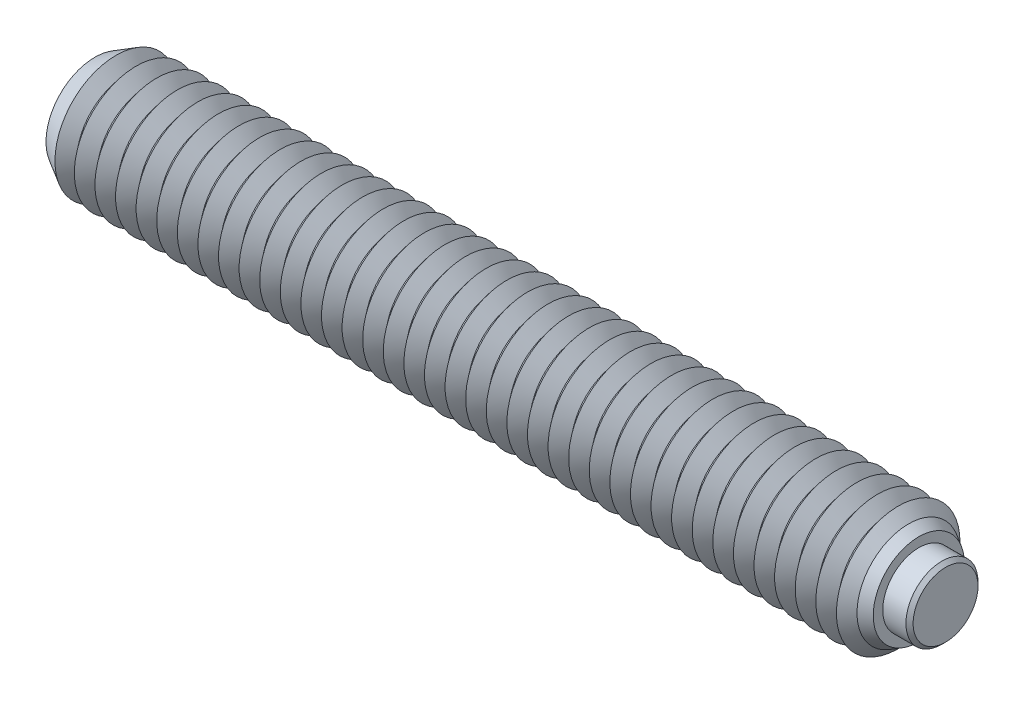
ISO-10303-21;
HEADER;
FILE_DESCRIPTION(('STEP AP214'),'2;1');
FILE_NAME('part.step','',(''),(''),'','','');
FILE_SCHEMA(('AUTOMOTIVE_DESIGN { 1 0 10303 214 1 1 1 1 }'));
ENDSEC;
DATA;
#1=APPLICATION_CONTEXT('core data for automotive mechanical design processes');
#2=APPLICATION_PROTOCOL_DEFINITION('international standard','automotive_design',2000,#1);
#3=PRODUCT_CONTEXT('',#1,'mechanical');
#4=PRODUCT('Part','Part','',(#3));
#5=PRODUCT_RELATED_PRODUCT_CATEGORY('part','',(#4));
#6=PRODUCT_DEFINITION_FORMATION('','',#4);
#7=PRODUCT_DEFINITION_CONTEXT('part definition',#1,'design');
#8=PRODUCT_DEFINITION('design','',#6,#7);
#9=PRODUCT_DEFINITION_SHAPE('','',#8);
#10=(LENGTH_UNIT() NAMED_UNIT(*) SI_UNIT(.MILLI.,.METRE.));
#11=(NAMED_UNIT(*) PLANE_ANGLE_UNIT() SI_UNIT($,.RADIAN.));
#12=(NAMED_UNIT(*) SI_UNIT($,.STERADIAN.) SOLID_ANGLE_UNIT());
#13=UNCERTAINTY_MEASURE_WITH_UNIT(LENGTH_MEASURE(1.E-05),#10,'distance_accuracy_value','');
#14=(GEOMETRIC_REPRESENTATION_CONTEXT(3) GLOBAL_UNCERTAINTY_ASSIGNED_CONTEXT((#13)) GLOBAL_UNIT_ASSIGNED_CONTEXT((#10,
#11,#12)) REPRESENTATION_CONTEXT('',''));
#15=CARTESIAN_POINT('',(0.,0.,0.));
#16=DIRECTION('',(0.,0.,1.));
#17=DIRECTION('',(1.,0.,0.));
#18=AXIS2_PLACEMENT_3D('',#15,#16,#17);
#19=CARTESIAN_POINT('',(1.8,0.,0.));
#20=DIRECTION('',(-1.,0.,0.));
#21=DIRECTION('',(0.,0.,1.));
#22=AXIS2_PLACEMENT_3D('',#19,#20,#21);
#23=CYLINDRICAL_SURFACE('',#22,1.75);
#24=CARTESIAN_POINT('',(1.625,0.,0.));
#25=DIRECTION('',(1.,0.,0.));
#26=DIRECTION('',(0.,0.,-1.));
#27=AXIS2_PLACEMENT_3D('',#24,#25,#26);
#28=CIRCLE('',#27,1.75);
#29=CARTESIAN_POINT('',(1.625,0.,-1.75));
#30=VERTEX_POINT('',#29);
#31=EDGE_CURVE('P0_E10',#30,#30,#28,.F.);
#32=ORIENTED_EDGE('',*,*,#31,.T.);
#33=EDGE_LOOP('',(#32));
#34=FACE_BOUND('',#33,.T.);
#35=CARTESIAN_POINT('',(-0.8,0.,0.));
#36=DIRECTION('',(1.,0.,0.));
#37=DIRECTION('',(0.,0.,-1.));
#38=AXIS2_PLACEMENT_3D('',#35,#36,#37);
#39=CIRCLE('',#38,1.75);
#40=CARTESIAN_POINT('',(-0.8,0.,-1.75));
#41=VERTEX_POINT('',#40);
#42=EDGE_CURVE('P0_E25',#41,#41,#39,.T.);
#43=ORIENTED_EDGE('',*,*,#42,.T.);
#44=EDGE_LOOP('',(#43));
#45=FACE_BOUND('',#44,.T.);
#46=ADVANCED_FACE('P0_F14',(#34,#45),#23,.T.);
#47=CARTESIAN_POINT('',(1.8,0.,0.));
#48=DIRECTION('',(1.,0.,0.));
#49=DIRECTION('',(0.,0.,-1.));
#50=AXIS2_PLACEMENT_3D('',#47,#48,#49);
#51=PLANE('',#50);
#52=CARTESIAN_POINT('',(1.8,0.,0.));
#53=DIRECTION('',(1.,0.,0.));
#54=DIRECTION('',(0.,0.,-1.));
#55=AXIS2_PLACEMENT_3D('',#52,#53,#54);
#56=CIRCLE('',#55,1.575);
#57=CARTESIAN_POINT('',(1.8,0.,-1.575));
#58=VERTEX_POINT('',#57);
#59=EDGE_CURVE('P0_E21',#58,#58,#56,.T.);
#60=ORIENTED_EDGE('',*,*,#59,.T.);
#61=EDGE_LOOP('',(#60));
#62=FACE_BOUND('',#61,.T.);
#63=ADVANCED_FACE('P0_F35',(#62),#51,.T.);
#64=CARTESIAN_POINT('',(-0.8,0.,0.));
#65=DIRECTION('',(1.,0.,0.));
#66=DIRECTION('',(0.,0.,-1.));
#67=AXIS2_PLACEMENT_3D('',#64,#65,#66);
#68=PLANE('',#67);
#69=ORIENTED_EDGE('',*,*,#42,.F.);
#70=EDGE_LOOP('',(#69));
#71=FACE_BOUND('',#70,.T.);
#72=ADVANCED_FACE('P0_F33',(#71),#68,.F.);
#73=CARTESIAN_POINT('',(1.8,0.,0.));
#74=DIRECTION('',(-1.,0.,0.));
#75=DIRECTION('',(0.,0.,1.));
#76=AXIS2_PLACEMENT_3D('',#73,#74,#75);
#77=CONICAL_SURFACE('',#76,1.575,0.785398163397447);
#78=ORIENTED_EDGE('',*,*,#31,.F.);
#79=EDGE_LOOP('',(#78));
#80=FACE_BOUND('',#79,.T.);
#81=ORIENTED_EDGE('',*,*,#59,.F.);
#82=EDGE_LOOP('',(#81));
#83=FACE_BOUND('',#82,.T.);
#84=ADVANCED_FACE('P0_F16',(#80,#83),#77,.T.);
#85=CLOSED_SHELL('',(#46,#63,#72,#84));
#86=MANIFOLD_SOLID_BREP('P0_B1',#85);
#87=CARTESIAN_POINT('',(-38.5,0.,0.));
#88=DIRECTION('',(-1.,0.,0.));
#89=DIRECTION('',(0.,0.,1.));
#90=AXIS2_PLACEMENT_3D('',#87,#88,#89);
#91=CONICAL_SURFACE('',#90,3.,0.895664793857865);
#92=CARTESIAN_POINT('',(-38.,0.,0.));
#93=DIRECTION('',(1.,0.,0.));
#94=DIRECTION('',(0.,0.,-1.));
#95=AXIS2_PLACEMENT_3D('',#92,#93,#94);
#96=CIRCLE('',#95,2.37550020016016);
#97=CARTESIAN_POINT('',(-38.,0.,-2.37550020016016));
#98=VERTEX_POINT('',#97);
#99=EDGE_CURVE('P1_E1477',#98,#98,#96,.T.);
#100=ORIENTED_EDGE('',*,*,#99,.F.);
#101=EDGE_LOOP('',(#100));
#102=FACE_BOUND('',#101,.T.);
#103=CARTESIAN_POINT('',(-38.4741837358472,0.,0.));
#104=DIRECTION('',(1.,0.,0.));
#105=DIRECTION('',(0.,0.,-1.));
#106=AXIS2_PLACEMENT_3D('',#103,#104,#105);
#107=CIRCLE('',#106,2.9677554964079);
#108=CARTESIAN_POINT('',(-38.4741837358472,0.,-2.9677554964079));
#109=VERTEX_POINT('',#108);
#110=EDGE_CURVE('P1_E1480',#109,#109,#107,.F.);
#111=ORIENTED_EDGE('',*,*,#110,.F.);
#112=EDGE_LOOP('',(#111));
#113=FACE_BOUND('',#112,.T.);
#114=ADVANCED_FACE('P1_F15',(#102,#113),#91,.T.);
#115=CARTESIAN_POINT('',(-1.,0.,0.));
#116=DIRECTION('',(1.,0.,0.));
#117=DIRECTION('',(0.,0.,-1.));
#118=AXIS2_PLACEMENT_3D('',#115,#116,#117);
#119=CONICAL_SURFACE('',#118,2.37550020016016,0.895664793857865);
#120=CARTESIAN_POINT('',(-0.5,0.,0.));
#121=DIRECTION('',(1.,0.,0.));
#122=DIRECTION('',(0.,0.,-1.));
#123=AXIS2_PLACEMENT_3D('',#120,#121,#122);
#124=CIRCLE('',#123,3.);
#125=CARTESIAN_POINT('',(-0.5,0.,-3.));
#126=VERTEX_POINT('',#125);
#127=EDGE_CURVE('P1_E1251',#126,#126,#124,.T.);
#128=ORIENTED_EDGE('',*,*,#127,.F.);
#129=EDGE_LOOP('',(#128));
#130=FACE_BOUND('',#129,.T.);
#131=CARTESIAN_POINT('',(-1.,0.,0.));
#132=DIRECTION('',(1.,0.,0.));
#133=DIRECTION('',(0.,0.,-1.));
#134=AXIS2_PLACEMENT_3D('',#131,#132,#133);
#135=CIRCLE('',#134,2.37550020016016);
#136=CARTESIAN_POINT('',(-1.,0.,-2.37550020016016));
#137=VERTEX_POINT('',#136);
#138=EDGE_CURVE('P1_E1252',#137,#137,#135,.T.);
#139=ORIENTED_EDGE('',*,*,#138,.T.);
#140=EDGE_LOOP('',(#139));
#141=FACE_BOUND('',#140,.T.);
#142=ADVANCED_FACE('P1_F222',(#130,#141),#119,.T.);
#143=CARTESIAN_POINT('',(-1.5,0.,0.));
#144=DIRECTION('',(-1.,0.,0.));
#145=DIRECTION('',(0.,0.,1.));
#146=AXIS2_PLACEMENT_3D('',#143,#144,#145);
#147=CONICAL_SURFACE('',#146,3.,0.895664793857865);
#148=ORIENTED_EDGE('',*,*,#138,.F.);
#149=EDGE_LOOP('',(#148));
#150=FACE_BOUND('',#149,.T.);
#151=CARTESIAN_POINT('',(-1.5,0.,0.));
#152=DIRECTION('',(1.,0.,0.));
#153=DIRECTION('',(0.,0.,-1.));
#154=AXIS2_PLACEMENT_3D('',#151,#152,#153);
#155=CIRCLE('',#154,3.);
#156=CARTESIAN_POINT('',(-1.5,0.,-3.));
#157=VERTEX_POINT('',#156);
#158=EDGE_CURVE('P1_E1256',#157,#157,#155,.T.);
#159=ORIENTED_EDGE('',*,*,#158,.T.);
#160=EDGE_LOOP('',(#159));
#161=FACE_BOUND('',#160,.T.);
#162=ADVANCED_FACE('P1_F227',(#150,#161),#147,.T.);
#163=CARTESIAN_POINT('',(-0.8,0.,0.));
#164=DIRECTION('',(1.,0.,0.));
#165=DIRECTION('',(0.,1.,0.));
#166=AXIS2_PLACEMENT_3D('',#163,#164,#165);
#167=PLANE('',#166);
#168=CARTESIAN_POINT('',(-0.8,0.,0.));
#169=DIRECTION('',(1.,0.,0.));
#170=DIRECTION('',(0.,1.,0.));
#171=AXIS2_PLACEMENT_3D('',#168,#169,#170);
#172=CIRCLE('',#171,1.75);
#173=CARTESIAN_POINT('',(-0.8,1.75,0.));
#174=VERTEX_POINT('',#173);
#175=EDGE_CURVE('P1_E598',#174,#174,#172,.T.);
#176=ORIENTED_EDGE('',*,*,#175,.T.);
#177=EDGE_LOOP('',(#176));
#178=FACE_BOUND('',#177,.T.);
#179=ADVANCED_FACE('P1_F525',(#178),#167,.T.);
#180=CARTESIAN_POINT('',(-0.8,0.,0.));
#181=DIRECTION('',(1.,0.,0.));
#182=DIRECTION('',(0.,1.,0.));
#183=AXIS2_PLACEMENT_3D('',#180,#181,#182);
#184=CYLINDRICAL_SURFACE('',#183,1.75);
#185=ORIENTED_EDGE('',*,*,#175,.F.);
#186=EDGE_LOOP('',(#185));
#187=FACE_BOUND('',#186,.T.);
#188=CARTESIAN_POINT('',(0.5,0.,0.));
#189=DIRECTION('',(1.,0.,0.));
#190=DIRECTION('',(0.,1.,0.));
#191=AXIS2_PLACEMENT_3D('',#188,#189,#190);
#192=CIRCLE('',#191,1.75);
#193=CARTESIAN_POINT('',(0.5,1.75,0.));
#194=VERTEX_POINT('',#193);
#195=EDGE_CURVE('P1_E601',#194,#194,#192,.T.);
#196=ORIENTED_EDGE('',*,*,#195,.T.);
#197=EDGE_LOOP('',(#196));
#198=FACE_BOUND('',#197,.T.);
#199=ADVANCED_FACE('P1_F209',(#187,#198),#184,.F.);
#200=CARTESIAN_POINT('',(0.5,2.21132486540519,0.));
#201=DIRECTION('',(1.,0.,0.));
#202=DIRECTION('',(0.,1.,0.));
#203=AXIS2_PLACEMENT_3D('',#200,#201,#202);
#204=PLANE('',#203);
#205=ORIENTED_EDGE('',*,*,#195,.F.);
#206=EDGE_LOOP('',(#205));
#207=FACE_BOUND('',#206,.T.);
#208=CARTESIAN_POINT('',(0.5,0.,0.));
#209=DIRECTION('',(1.,0.,0.));
#210=DIRECTION('',(0.,1.,0.));
#211=AXIS2_PLACEMENT_3D('',#208,#209,#210);
#212=CIRCLE('',#211,2.21132486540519);
#213=CARTESIAN_POINT('',(0.5,2.21132486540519,0.));
#214=VERTEX_POINT('',#213);
#215=EDGE_CURVE('P1_E121',#214,#214,#212,.T.);
#216=ORIENTED_EDGE('',*,*,#215,.T.);
#217=EDGE_LOOP('',(#216));
#218=FACE_BOUND('',#217,.T.);
#219=ADVANCED_FACE('P1_F206',(#207,#218),#204,.T.);
#220=CARTESIAN_POINT('',(0.5,0.,0.));
#221=DIRECTION('',(-1.,0.,0.));
#222=DIRECTION('',(0.,-1.,0.));
#223=AXIS2_PLACEMENT_3D('',#220,#221,#222);
#224=CONICAL_SURFACE('',#223,2.21132486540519,0.523598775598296);
#225=CARTESIAN_POINT('',(0.,0.,0.));
#226=DIRECTION('',(1.,0.,0.));
#227=DIRECTION('',(0.,0.,-1.));
#228=AXIS2_PLACEMENT_3D('',#225,#226,#227);
#229=CIRCLE('',#228,2.5);
#230=CARTESIAN_POINT('',(0.,0.,-2.5));
#231=VERTEX_POINT('',#230);
#232=EDGE_CURVE('P1_E589',#231,#231,#229,.T.);
#233=ORIENTED_EDGE('',*,*,#232,.T.);
#234=EDGE_LOOP('',(#233));
#235=FACE_BOUND('',#234,.T.);
#236=ORIENTED_EDGE('',*,*,#215,.F.);
#237=EDGE_LOOP('',(#236));
#238=FACE_BOUND('',#237,.T.);
#239=ADVANCED_FACE('P1_F203',(#235,#238),#224,.T.);
#240=CARTESIAN_POINT('',(0.,0.,0.));
#241=DIRECTION('',(-1.,0.,0.));
#242=DIRECTION('',(0.,0.,1.));
#243=AXIS2_PLACEMENT_3D('',#240,#241,#242);
#244=CONICAL_SURFACE('',#243,2.5,0.785398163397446);
#245=ORIENTED_EDGE('',*,*,#127,.T.);
#246=EDGE_LOOP('',(#245));
#247=FACE_BOUND('',#246,.T.);
#248=ORIENTED_EDGE('',*,*,#232,.F.);
#249=EDGE_LOOP('',(#248));
#250=FACE_BOUND('',#249,.T.);
#251=ADVANCED_FACE('P1_F17',(#247,#250),#244,.T.);
#252=CARTESIAN_POINT('',(-2.,0.,0.));
#253=DIRECTION('',(1.,0.,0.));
#254=DIRECTION('',(0.,0.,-1.));
#255=AXIS2_PLACEMENT_3D('',#252,#253,#254);
#256=CONICAL_SURFACE('',#255,2.37550020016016,0.895664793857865);
#257=ORIENTED_EDGE('',*,*,#158,.F.);
#258=EDGE_LOOP('',(#257));
#259=FACE_BOUND('',#258,.T.);
#260=CARTESIAN_POINT('',(-2.,0.,0.));
#261=DIRECTION('',(1.,0.,0.));
#262=DIRECTION('',(0.,0.,-1.));
#263=AXIS2_PLACEMENT_3D('',#260,#261,#262);
#264=CIRCLE('',#263,2.37550020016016);
#265=CARTESIAN_POINT('',(-2.,0.,-2.37550020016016));
#266=VERTEX_POINT('',#265);
#267=EDGE_CURVE('P1_E1261',#266,#266,#264,.T.);
#268=ORIENTED_EDGE('',*,*,#267,.T.);
#269=EDGE_LOOP('',(#268));
#270=FACE_BOUND('',#269,.T.);
#271=ADVANCED_FACE('P1_F519',(#259,#270),#256,.T.);
#272=CARTESIAN_POINT('',(-2.5,0.,0.));
#273=DIRECTION('',(-1.,0.,0.));
#274=DIRECTION('',(0.,0.,1.));
#275=AXIS2_PLACEMENT_3D('',#272,#273,#274);
#276=CONICAL_SURFACE('',#275,3.,0.895664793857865);
#277=ORIENTED_EDGE('',*,*,#267,.F.);
#278=EDGE_LOOP('',(#277));
#279=FACE_BOUND('',#278,.T.);
#280=CARTESIAN_POINT('',(-2.5,0.,0.));
#281=DIRECTION('',(1.,0.,0.));
#282=DIRECTION('',(0.,0.,-1.));
#283=AXIS2_PLACEMENT_3D('',#280,#281,#282);
#284=CIRCLE('',#283,3.);
#285=CARTESIAN_POINT('',(-2.5,0.,-3.));
#286=VERTEX_POINT('',#285);
#287=EDGE_CURVE('P1_E1264',#286,#286,#284,.T.);
#288=ORIENTED_EDGE('',*,*,#287,.T.);
#289=EDGE_LOOP('',(#288));
#290=FACE_BOUND('',#289,.T.);
#291=ADVANCED_FACE('P1_F515',(#279,#290),#276,.T.);
#292=CARTESIAN_POINT('',(-3.,0.,0.));
#293=DIRECTION('',(1.,0.,0.));
#294=DIRECTION('',(0.,0.,-1.));
#295=AXIS2_PLACEMENT_3D('',#292,#293,#294);
#296=CONICAL_SURFACE('',#295,2.37550020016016,0.895664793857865);
#297=ORIENTED_EDGE('',*,*,#287,.F.);
#298=EDGE_LOOP('',(#297));
#299=FACE_BOUND('',#298,.T.);
#300=CARTESIAN_POINT('',(-3.,0.,0.));
#301=DIRECTION('',(1.,0.,0.));
#302=DIRECTION('',(0.,0.,-1.));
#303=AXIS2_PLACEMENT_3D('',#300,#301,#302);
#304=CIRCLE('',#303,2.37550020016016);
#305=CARTESIAN_POINT('',(-3.,0.,-2.37550020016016));
#306=VERTEX_POINT('',#305);
#307=EDGE_CURVE('P1_E1267',#306,#306,#304,.T.);
#308=ORIENTED_EDGE('',*,*,#307,.T.);
#309=EDGE_LOOP('',(#308));
#310=FACE_BOUND('',#309,.T.);
#311=ADVANCED_FACE('P1_F511',(#299,#310),#296,.T.);
#312=CARTESIAN_POINT('',(-3.5,0.,0.));
#313=DIRECTION('',(-1.,0.,0.));
#314=DIRECTION('',(0.,0.,1.));
#315=AXIS2_PLACEMENT_3D('',#312,#313,#314);
#316=CONICAL_SURFACE('',#315,3.,0.895664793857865);
#317=ORIENTED_EDGE('',*,*,#307,.F.);
#318=EDGE_LOOP('',(#317));
#319=FACE_BOUND('',#318,.T.);
#320=CARTESIAN_POINT('',(-3.5,0.,0.));
#321=DIRECTION('',(1.,0.,0.));
#322=DIRECTION('',(0.,0.,-1.));
#323=AXIS2_PLACEMENT_3D('',#320,#321,#322);
#324=CIRCLE('',#323,3.);
#325=CARTESIAN_POINT('',(-3.5,0.,-3.));
#326=VERTEX_POINT('',#325);
#327=EDGE_CURVE('P1_E1270',#326,#326,#324,.T.);
#328=ORIENTED_EDGE('',*,*,#327,.T.);
#329=EDGE_LOOP('',(#328));
#330=FACE_BOUND('',#329,.T.);
#331=ADVANCED_FACE('P1_F507',(#319,#330),#316,.T.);
#332=CARTESIAN_POINT('',(-4.,0.,0.));
#333=DIRECTION('',(1.,0.,0.));
#334=DIRECTION('',(0.,0.,-1.));
#335=AXIS2_PLACEMENT_3D('',#332,#333,#334);
#336=CONICAL_SURFACE('',#335,2.37550020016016,0.895664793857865);
#337=ORIENTED_EDGE('',*,*,#327,.F.);
#338=EDGE_LOOP('',(#337));
#339=FACE_BOUND('',#338,.T.);
#340=CARTESIAN_POINT('',(-4.,0.,0.));
#341=DIRECTION('',(1.,0.,0.));
#342=DIRECTION('',(0.,0.,-1.));
#343=AXIS2_PLACEMENT_3D('',#340,#341,#342);
#344=CIRCLE('',#343,2.37550020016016);
#345=CARTESIAN_POINT('',(-4.,0.,-2.37550020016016));
#346=VERTEX_POINT('',#345);
#347=EDGE_CURVE('P1_E1273',#346,#346,#344,.T.);
#348=ORIENTED_EDGE('',*,*,#347,.T.);
#349=EDGE_LOOP('',(#348));
#350=FACE_BOUND('',#349,.T.);
#351=ADVANCED_FACE('P1_F503',(#339,#350),#336,.T.);
#352=CARTESIAN_POINT('',(-4.5,0.,0.));
#353=DIRECTION('',(-1.,0.,0.));
#354=DIRECTION('',(0.,0.,1.));
#355=AXIS2_PLACEMENT_3D('',#352,#353,#354);
#356=CONICAL_SURFACE('',#355,3.,0.895664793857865);
#357=ORIENTED_EDGE('',*,*,#347,.F.);
#358=EDGE_LOOP('',(#357));
#359=FACE_BOUND('',#358,.T.);
#360=CARTESIAN_POINT('',(-4.5,0.,0.));
#361=DIRECTION('',(1.,0.,0.));
#362=DIRECTION('',(0.,0.,-1.));
#363=AXIS2_PLACEMENT_3D('',#360,#361,#362);
#364=CIRCLE('',#363,3.);
#365=CARTESIAN_POINT('',(-4.5,0.,-3.));
#366=VERTEX_POINT('',#365);
#367=EDGE_CURVE('P1_E1276',#366,#366,#364,.T.);
#368=ORIENTED_EDGE('',*,*,#367,.T.);
#369=EDGE_LOOP('',(#368));
#370=FACE_BOUND('',#369,.T.);
#371=ADVANCED_FACE('P1_F499',(#359,#370),#356,.T.);
#372=CARTESIAN_POINT('',(-5.,0.,0.));
#373=DIRECTION('',(1.,0.,0.));
#374=DIRECTION('',(0.,0.,-1.));
#375=AXIS2_PLACEMENT_3D('',#372,#373,#374);
#376=CONICAL_SURFACE('',#375,2.37550020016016,0.895664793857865);
#377=ORIENTED_EDGE('',*,*,#367,.F.);
#378=EDGE_LOOP('',(#377));
#379=FACE_BOUND('',#378,.T.);
#380=CARTESIAN_POINT('',(-5.,0.,0.));
#381=DIRECTION('',(1.,0.,0.));
#382=DIRECTION('',(0.,0.,-1.));
#383=AXIS2_PLACEMENT_3D('',#380,#381,#382);
#384=CIRCLE('',#383,2.37550020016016);
#385=CARTESIAN_POINT('',(-5.,0.,-2.37550020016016));
#386=VERTEX_POINT('',#385);
#387=EDGE_CURVE('P1_E1279',#386,#386,#384,.T.);
#388=ORIENTED_EDGE('',*,*,#387,.T.);
#389=EDGE_LOOP('',(#388));
#390=FACE_BOUND('',#389,.T.);
#391=ADVANCED_FACE('P1_F495',(#379,#390),#376,.T.);
#392=CARTESIAN_POINT('',(-5.5,0.,0.));
#393=DIRECTION('',(-1.,0.,0.));
#394=DIRECTION('',(0.,0.,1.));
#395=AXIS2_PLACEMENT_3D('',#392,#393,#394);
#396=CONICAL_SURFACE('',#395,3.,0.895664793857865);
#397=ORIENTED_EDGE('',*,*,#387,.F.);
#398=EDGE_LOOP('',(#397));
#399=FACE_BOUND('',#398,.T.);
#400=CARTESIAN_POINT('',(-5.5,0.,0.));
#401=DIRECTION('',(1.,0.,0.));
#402=DIRECTION('',(0.,0.,-1.));
#403=AXIS2_PLACEMENT_3D('',#400,#401,#402);
#404=CIRCLE('',#403,3.);
#405=CARTESIAN_POINT('',(-5.5,0.,-3.));
#406=VERTEX_POINT('',#405);
#407=EDGE_CURVE('P1_E1282',#406,#406,#404,.T.);
#408=ORIENTED_EDGE('',*,*,#407,.T.);
#409=EDGE_LOOP('',(#408));
#410=FACE_BOUND('',#409,.T.);
#411=ADVANCED_FACE('P1_F491',(#399,#410),#396,.T.);
#412=CARTESIAN_POINT('',(-6.,0.,0.));
#413=DIRECTION('',(1.,0.,0.));
#414=DIRECTION('',(0.,0.,-1.));
#415=AXIS2_PLACEMENT_3D('',#412,#413,#414);
#416=CONICAL_SURFACE('',#415,2.37550020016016,0.895664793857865);
#417=ORIENTED_EDGE('',*,*,#407,.F.);
#418=EDGE_LOOP('',(#417));
#419=FACE_BOUND('',#418,.T.);
#420=CARTESIAN_POINT('',(-6.,0.,0.));
#421=DIRECTION('',(1.,0.,0.));
#422=DIRECTION('',(0.,0.,-1.));
#423=AXIS2_PLACEMENT_3D('',#420,#421,#422);
#424=CIRCLE('',#423,2.37550020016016);
#425=CARTESIAN_POINT('',(-6.,0.,-2.37550020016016));
#426=VERTEX_POINT('',#425);
#427=EDGE_CURVE('P1_E1285',#426,#426,#424,.T.);
#428=ORIENTED_EDGE('',*,*,#427,.T.);
#429=EDGE_LOOP('',(#428));
#430=FACE_BOUND('',#429,.T.);
#431=ADVANCED_FACE('P1_F487',(#419,#430),#416,.T.);
#432=CARTESIAN_POINT('',(-6.5,0.,0.));
#433=DIRECTION('',(-1.,0.,0.));
#434=DIRECTION('',(0.,0.,1.));
#435=AXIS2_PLACEMENT_3D('',#432,#433,#434);
#436=CONICAL_SURFACE('',#435,3.,0.895664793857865);
#437=ORIENTED_EDGE('',*,*,#427,.F.);
#438=EDGE_LOOP('',(#437));
#439=FACE_BOUND('',#438,.T.);
#440=CARTESIAN_POINT('',(-6.5,0.,0.));
#441=DIRECTION('',(1.,0.,0.));
#442=DIRECTION('',(0.,0.,-1.));
#443=AXIS2_PLACEMENT_3D('',#440,#441,#442);
#444=CIRCLE('',#443,3.);
#445=CARTESIAN_POINT('',(-6.5,0.,-3.));
#446=VERTEX_POINT('',#445);
#447=EDGE_CURVE('P1_E1288',#446,#446,#444,.T.);
#448=ORIENTED_EDGE('',*,*,#447,.T.);
#449=EDGE_LOOP('',(#448));
#450=FACE_BOUND('',#449,.T.);
#451=ADVANCED_FACE('P1_F483',(#439,#450),#436,.T.);
#452=CARTESIAN_POINT('',(-7.,0.,0.));
#453=DIRECTION('',(1.,0.,0.));
#454=DIRECTION('',(0.,0.,-1.));
#455=AXIS2_PLACEMENT_3D('',#452,#453,#454);
#456=CONICAL_SURFACE('',#455,2.37550020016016,0.895664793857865);
#457=ORIENTED_EDGE('',*,*,#447,.F.);
#458=EDGE_LOOP('',(#457));
#459=FACE_BOUND('',#458,.T.);
#460=CARTESIAN_POINT('',(-7.,0.,0.));
#461=DIRECTION('',(1.,0.,0.));
#462=DIRECTION('',(0.,0.,-1.));
#463=AXIS2_PLACEMENT_3D('',#460,#461,#462);
#464=CIRCLE('',#463,2.37550020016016);
#465=CARTESIAN_POINT('',(-7.,0.,-2.37550020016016));
#466=VERTEX_POINT('',#465);
#467=EDGE_CURVE('P1_E1291',#466,#466,#464,.T.);
#468=ORIENTED_EDGE('',*,*,#467,.T.);
#469=EDGE_LOOP('',(#468));
#470=FACE_BOUND('',#469,.T.);
#471=ADVANCED_FACE('P1_F479',(#459,#470),#456,.T.);
#472=CARTESIAN_POINT('',(-7.5,0.,0.));
#473=DIRECTION('',(-1.,0.,0.));
#474=DIRECTION('',(0.,0.,1.));
#475=AXIS2_PLACEMENT_3D('',#472,#473,#474);
#476=CONICAL_SURFACE('',#475,3.,0.895664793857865);
#477=ORIENTED_EDGE('',*,*,#467,.F.);
#478=EDGE_LOOP('',(#477));
#479=FACE_BOUND('',#478,.T.);
#480=CARTESIAN_POINT('',(-7.5,0.,0.));
#481=DIRECTION('',(1.,0.,0.));
#482=DIRECTION('',(0.,0.,-1.));
#483=AXIS2_PLACEMENT_3D('',#480,#481,#482);
#484=CIRCLE('',#483,3.);
#485=CARTESIAN_POINT('',(-7.5,0.,-3.));
#486=VERTEX_POINT('',#485);
#487=EDGE_CURVE('P1_E1294',#486,#486,#484,.T.);
#488=ORIENTED_EDGE('',*,*,#487,.T.);
#489=EDGE_LOOP('',(#488));
#490=FACE_BOUND('',#489,.T.);
#491=ADVANCED_FACE('P1_F475',(#479,#490),#476,.T.);
#492=CARTESIAN_POINT('',(-8.,0.,0.));
#493=DIRECTION('',(1.,0.,0.));
#494=DIRECTION('',(0.,0.,-1.));
#495=AXIS2_PLACEMENT_3D('',#492,#493,#494);
#496=CONICAL_SURFACE('',#495,2.37550020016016,0.895664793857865);
#497=ORIENTED_EDGE('',*,*,#487,.F.);
#498=EDGE_LOOP('',(#497));
#499=FACE_BOUND('',#498,.T.);
#500=CARTESIAN_POINT('',(-8.,0.,0.));
#501=DIRECTION('',(1.,0.,0.));
#502=DIRECTION('',(0.,0.,-1.));
#503=AXIS2_PLACEMENT_3D('',#500,#501,#502);
#504=CIRCLE('',#503,2.37550020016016);
#505=CARTESIAN_POINT('',(-8.,0.,-2.37550020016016));
#506=VERTEX_POINT('',#505);
#507=EDGE_CURVE('P1_E1297',#506,#506,#504,.T.);
#508=ORIENTED_EDGE('',*,*,#507,.T.);
#509=EDGE_LOOP('',(#508));
#510=FACE_BOUND('',#509,.T.);
#511=ADVANCED_FACE('P1_F471',(#499,#510),#496,.T.);
#512=CARTESIAN_POINT('',(-8.5,0.,0.));
#513=DIRECTION('',(-1.,0.,0.));
#514=DIRECTION('',(0.,0.,1.));
#515=AXIS2_PLACEMENT_3D('',#512,#513,#514);
#516=CONICAL_SURFACE('',#515,3.,0.895664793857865);
#517=ORIENTED_EDGE('',*,*,#507,.F.);
#518=EDGE_LOOP('',(#517));
#519=FACE_BOUND('',#518,.T.);
#520=CARTESIAN_POINT('',(-8.5,0.,0.));
#521=DIRECTION('',(1.,0.,0.));
#522=DIRECTION('',(0.,0.,-1.));
#523=AXIS2_PLACEMENT_3D('',#520,#521,#522);
#524=CIRCLE('',#523,3.);
#525=CARTESIAN_POINT('',(-8.5,0.,-3.));
#526=VERTEX_POINT('',#525);
#527=EDGE_CURVE('P1_E1300',#526,#526,#524,.T.);
#528=ORIENTED_EDGE('',*,*,#527,.T.);
#529=EDGE_LOOP('',(#528));
#530=FACE_BOUND('',#529,.T.);
#531=ADVANCED_FACE('P1_F467',(#519,#530),#516,.T.);
#532=CARTESIAN_POINT('',(-9.,0.,0.));
#533=DIRECTION('',(1.,0.,0.));
#534=DIRECTION('',(0.,0.,-1.));
#535=AXIS2_PLACEMENT_3D('',#532,#533,#534);
#536=CONICAL_SURFACE('',#535,2.37550020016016,0.895664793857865);
#537=ORIENTED_EDGE('',*,*,#527,.F.);
#538=EDGE_LOOP('',(#537));
#539=FACE_BOUND('',#538,.T.);
#540=CARTESIAN_POINT('',(-9.,0.,0.));
#541=DIRECTION('',(1.,0.,0.));
#542=DIRECTION('',(0.,0.,-1.));
#543=AXIS2_PLACEMENT_3D('',#540,#541,#542);
#544=CIRCLE('',#543,2.37550020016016);
#545=CARTESIAN_POINT('',(-9.,0.,-2.37550020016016));
#546=VERTEX_POINT('',#545);
#547=EDGE_CURVE('P1_E1303',#546,#546,#544,.T.);
#548=ORIENTED_EDGE('',*,*,#547,.T.);
#549=EDGE_LOOP('',(#548));
#550=FACE_BOUND('',#549,.T.);
#551=ADVANCED_FACE('P1_F463',(#539,#550),#536,.T.);
#552=CARTESIAN_POINT('',(-9.5,0.,0.));
#553=DIRECTION('',(-1.,0.,0.));
#554=DIRECTION('',(0.,0.,1.));
#555=AXIS2_PLACEMENT_3D('',#552,#553,#554);
#556=CONICAL_SURFACE('',#555,3.,0.895664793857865);
#557=ORIENTED_EDGE('',*,*,#547,.F.);
#558=EDGE_LOOP('',(#557));
#559=FACE_BOUND('',#558,.T.);
#560=CARTESIAN_POINT('',(-9.5,0.,0.));
#561=DIRECTION('',(1.,0.,0.));
#562=DIRECTION('',(0.,0.,-1.));
#563=AXIS2_PLACEMENT_3D('',#560,#561,#562);
#564=CIRCLE('',#563,3.);
#565=CARTESIAN_POINT('',(-9.5,0.,-3.));
#566=VERTEX_POINT('',#565);
#567=EDGE_CURVE('P1_E1306',#566,#566,#564,.T.);
#568=ORIENTED_EDGE('',*,*,#567,.T.);
#569=EDGE_LOOP('',(#568));
#570=FACE_BOUND('',#569,.T.);
#571=ADVANCED_FACE('P1_F459',(#559,#570),#556,.T.);
#572=CARTESIAN_POINT('',(-10.,0.,0.));
#573=DIRECTION('',(1.,0.,0.));
#574=DIRECTION('',(0.,0.,-1.));
#575=AXIS2_PLACEMENT_3D('',#572,#573,#574);
#576=CONICAL_SURFACE('',#575,2.37550020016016,0.895664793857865);
#577=ORIENTED_EDGE('',*,*,#567,.F.);
#578=EDGE_LOOP('',(#577));
#579=FACE_BOUND('',#578,.T.);
#580=CARTESIAN_POINT('',(-10.,0.,0.));
#581=DIRECTION('',(1.,0.,0.));
#582=DIRECTION('',(0.,0.,-1.));
#583=AXIS2_PLACEMENT_3D('',#580,#581,#582);
#584=CIRCLE('',#583,2.37550020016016);
#585=CARTESIAN_POINT('',(-10.,0.,-2.37550020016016));
#586=VERTEX_POINT('',#585);
#587=EDGE_CURVE('P1_E1309',#586,#586,#584,.T.);
#588=ORIENTED_EDGE('',*,*,#587,.T.);
#589=EDGE_LOOP('',(#588));
#590=FACE_BOUND('',#589,.T.);
#591=ADVANCED_FACE('P1_F455',(#579,#590),#576,.T.);
#592=CARTESIAN_POINT('',(-10.5,0.,0.));
#593=DIRECTION('',(-1.,0.,0.));
#594=DIRECTION('',(0.,0.,1.));
#595=AXIS2_PLACEMENT_3D('',#592,#593,#594);
#596=CONICAL_SURFACE('',#595,3.,0.895664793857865);
#597=ORIENTED_EDGE('',*,*,#587,.F.);
#598=EDGE_LOOP('',(#597));
#599=FACE_BOUND('',#598,.T.);
#600=CARTESIAN_POINT('',(-10.5,0.,0.));
#601=DIRECTION('',(1.,0.,0.));
#602=DIRECTION('',(0.,0.,-1.));
#603=AXIS2_PLACEMENT_3D('',#600,#601,#602);
#604=CIRCLE('',#603,3.);
#605=CARTESIAN_POINT('',(-10.5,0.,-3.));
#606=VERTEX_POINT('',#605);
#607=EDGE_CURVE('P1_E1312',#606,#606,#604,.T.);
#608=ORIENTED_EDGE('',*,*,#607,.T.);
#609=EDGE_LOOP('',(#608));
#610=FACE_BOUND('',#609,.T.);
#611=ADVANCED_FACE('P1_F451',(#599,#610),#596,.T.);
#612=CARTESIAN_POINT('',(-11.,0.,0.));
#613=DIRECTION('',(1.,0.,0.));
#614=DIRECTION('',(0.,0.,-1.));
#615=AXIS2_PLACEMENT_3D('',#612,#613,#614);
#616=CONICAL_SURFACE('',#615,2.37550020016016,0.895664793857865);
#617=ORIENTED_EDGE('',*,*,#607,.F.);
#618=EDGE_LOOP('',(#617));
#619=FACE_BOUND('',#618,.T.);
#620=CARTESIAN_POINT('',(-11.,0.,0.));
#621=DIRECTION('',(1.,0.,0.));
#622=DIRECTION('',(0.,0.,-1.));
#623=AXIS2_PLACEMENT_3D('',#620,#621,#622);
#624=CIRCLE('',#623,2.37550020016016);
#625=CARTESIAN_POINT('',(-11.,0.,-2.37550020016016));
#626=VERTEX_POINT('',#625);
#627=EDGE_CURVE('P1_E1315',#626,#626,#624,.T.);
#628=ORIENTED_EDGE('',*,*,#627,.T.);
#629=EDGE_LOOP('',(#628));
#630=FACE_BOUND('',#629,.T.);
#631=ADVANCED_FACE('P1_F447',(#619,#630),#616,.T.);
#632=CARTESIAN_POINT('',(-11.5,0.,0.));
#633=DIRECTION('',(-1.,0.,0.));
#634=DIRECTION('',(0.,0.,1.));
#635=AXIS2_PLACEMENT_3D('',#632,#633,#634);
#636=CONICAL_SURFACE('',#635,3.,0.895664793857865);
#637=ORIENTED_EDGE('',*,*,#627,.F.);
#638=EDGE_LOOP('',(#637));
#639=FACE_BOUND('',#638,.T.);
#640=CARTESIAN_POINT('',(-11.5,0.,0.));
#641=DIRECTION('',(1.,0.,0.));
#642=DIRECTION('',(0.,0.,-1.));
#643=AXIS2_PLACEMENT_3D('',#640,#641,#642);
#644=CIRCLE('',#643,3.);
#645=CARTESIAN_POINT('',(-11.5,0.,-3.));
#646=VERTEX_POINT('',#645);
#647=EDGE_CURVE('P1_E1318',#646,#646,#644,.T.);
#648=ORIENTED_EDGE('',*,*,#647,.T.);
#649=EDGE_LOOP('',(#648));
#650=FACE_BOUND('',#649,.T.);
#651=ADVANCED_FACE('P1_F443',(#639,#650),#636,.T.);
#652=CARTESIAN_POINT('',(-12.,0.,0.));
#653=DIRECTION('',(1.,0.,0.));
#654=DIRECTION('',(0.,0.,-1.));
#655=AXIS2_PLACEMENT_3D('',#652,#653,#654);
#656=CONICAL_SURFACE('',#655,2.37550020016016,0.895664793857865);
#657=ORIENTED_EDGE('',*,*,#647,.F.);
#658=EDGE_LOOP('',(#657));
#659=FACE_BOUND('',#658,.T.);
#660=CARTESIAN_POINT('',(-12.,0.,0.));
#661=DIRECTION('',(1.,0.,0.));
#662=DIRECTION('',(0.,0.,-1.));
#663=AXIS2_PLACEMENT_3D('',#660,#661,#662);
#664=CIRCLE('',#663,2.37550020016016);
#665=CARTESIAN_POINT('',(-12.,0.,-2.37550020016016));
#666=VERTEX_POINT('',#665);
#667=EDGE_CURVE('P1_E1321',#666,#666,#664,.T.);
#668=ORIENTED_EDGE('',*,*,#667,.T.);
#669=EDGE_LOOP('',(#668));
#670=FACE_BOUND('',#669,.T.);
#671=ADVANCED_FACE('P1_F439',(#659,#670),#656,.T.);
#672=CARTESIAN_POINT('',(-12.5,0.,0.));
#673=DIRECTION('',(-1.,0.,0.));
#674=DIRECTION('',(0.,0.,1.));
#675=AXIS2_PLACEMENT_3D('',#672,#673,#674);
#676=CONICAL_SURFACE('',#675,3.,0.895664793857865);
#677=ORIENTED_EDGE('',*,*,#667,.F.);
#678=EDGE_LOOP('',(#677));
#679=FACE_BOUND('',#678,.T.);
#680=CARTESIAN_POINT('',(-12.5,0.,0.));
#681=DIRECTION('',(1.,0.,0.));
#682=DIRECTION('',(0.,0.,-1.));
#683=AXIS2_PLACEMENT_3D('',#680,#681,#682);
#684=CIRCLE('',#683,3.);
#685=CARTESIAN_POINT('',(-12.5,0.,-3.));
#686=VERTEX_POINT('',#685);
#687=EDGE_CURVE('P1_E1324',#686,#686,#684,.T.);
#688=ORIENTED_EDGE('',*,*,#687,.T.);
#689=EDGE_LOOP('',(#688));
#690=FACE_BOUND('',#689,.T.);
#691=ADVANCED_FACE('P1_F435',(#679,#690),#676,.T.);
#692=CARTESIAN_POINT('',(-13.,0.,0.));
#693=DIRECTION('',(1.,0.,0.));
#694=DIRECTION('',(0.,0.,-1.));
#695=AXIS2_PLACEMENT_3D('',#692,#693,#694);
#696=CONICAL_SURFACE('',#695,2.37550020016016,0.895664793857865);
#697=ORIENTED_EDGE('',*,*,#687,.F.);
#698=EDGE_LOOP('',(#697));
#699=FACE_BOUND('',#698,.T.);
#700=CARTESIAN_POINT('',(-13.,0.,0.));
#701=DIRECTION('',(1.,0.,0.));
#702=DIRECTION('',(0.,0.,-1.));
#703=AXIS2_PLACEMENT_3D('',#700,#701,#702);
#704=CIRCLE('',#703,2.37550020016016);
#705=CARTESIAN_POINT('',(-13.,0.,-2.37550020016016));
#706=VERTEX_POINT('',#705);
#707=EDGE_CURVE('P1_E1327',#706,#706,#704,.T.);
#708=ORIENTED_EDGE('',*,*,#707,.T.);
#709=EDGE_LOOP('',(#708));
#710=FACE_BOUND('',#709,.T.);
#711=ADVANCED_FACE('P1_F431',(#699,#710),#696,.T.);
#712=CARTESIAN_POINT('',(-13.5,0.,0.));
#713=DIRECTION('',(-1.,0.,0.));
#714=DIRECTION('',(0.,0.,1.));
#715=AXIS2_PLACEMENT_3D('',#712,#713,#714);
#716=CONICAL_SURFACE('',#715,3.,0.895664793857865);
#717=ORIENTED_EDGE('',*,*,#707,.F.);
#718=EDGE_LOOP('',(#717));
#719=FACE_BOUND('',#718,.T.);
#720=CARTESIAN_POINT('',(-13.5,0.,0.));
#721=DIRECTION('',(1.,0.,0.));
#722=DIRECTION('',(0.,0.,-1.));
#723=AXIS2_PLACEMENT_3D('',#720,#721,#722);
#724=CIRCLE('',#723,3.);
#725=CARTESIAN_POINT('',(-13.5,0.,-3.));
#726=VERTEX_POINT('',#725);
#727=EDGE_CURVE('P1_E1330',#726,#726,#724,.T.);
#728=ORIENTED_EDGE('',*,*,#727,.T.);
#729=EDGE_LOOP('',(#728));
#730=FACE_BOUND('',#729,.T.);
#731=ADVANCED_FACE('P1_F427',(#719,#730),#716,.T.);
#732=CARTESIAN_POINT('',(-14.,0.,0.));
#733=DIRECTION('',(1.,0.,0.));
#734=DIRECTION('',(0.,0.,-1.));
#735=AXIS2_PLACEMENT_3D('',#732,#733,#734);
#736=CONICAL_SURFACE('',#735,2.37550020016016,0.895664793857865);
#737=ORIENTED_EDGE('',*,*,#727,.F.);
#738=EDGE_LOOP('',(#737));
#739=FACE_BOUND('',#738,.T.);
#740=CARTESIAN_POINT('',(-14.,0.,0.));
#741=DIRECTION('',(1.,0.,0.));
#742=DIRECTION('',(0.,0.,-1.));
#743=AXIS2_PLACEMENT_3D('',#740,#741,#742);
#744=CIRCLE('',#743,2.37550020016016);
#745=CARTESIAN_POINT('',(-14.,0.,-2.37550020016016));
#746=VERTEX_POINT('',#745);
#747=EDGE_CURVE('P1_E1333',#746,#746,#744,.T.);
#748=ORIENTED_EDGE('',*,*,#747,.T.);
#749=EDGE_LOOP('',(#748));
#750=FACE_BOUND('',#749,.T.);
#751=ADVANCED_FACE('P1_F423',(#739,#750),#736,.T.);
#752=CARTESIAN_POINT('',(-14.5,0.,0.));
#753=DIRECTION('',(-1.,0.,0.));
#754=DIRECTION('',(0.,0.,1.));
#755=AXIS2_PLACEMENT_3D('',#752,#753,#754);
#756=CONICAL_SURFACE('',#755,3.,0.895664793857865);
#757=ORIENTED_EDGE('',*,*,#747,.F.);
#758=EDGE_LOOP('',(#757));
#759=FACE_BOUND('',#758,.T.);
#760=CARTESIAN_POINT('',(-14.5,0.,0.));
#761=DIRECTION('',(1.,0.,0.));
#762=DIRECTION('',(0.,0.,-1.));
#763=AXIS2_PLACEMENT_3D('',#760,#761,#762);
#764=CIRCLE('',#763,3.);
#765=CARTESIAN_POINT('',(-14.5,0.,-3.));
#766=VERTEX_POINT('',#765);
#767=EDGE_CURVE('P1_E1336',#766,#766,#764,.T.);
#768=ORIENTED_EDGE('',*,*,#767,.T.);
#769=EDGE_LOOP('',(#768));
#770=FACE_BOUND('',#769,.T.);
#771=ADVANCED_FACE('P1_F419',(#759,#770),#756,.T.);
#772=CARTESIAN_POINT('',(-15.,0.,0.));
#773=DIRECTION('',(1.,0.,0.));
#774=DIRECTION('',(0.,0.,-1.));
#775=AXIS2_PLACEMENT_3D('',#772,#773,#774);
#776=CONICAL_SURFACE('',#775,2.37550020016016,0.895664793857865);
#777=ORIENTED_EDGE('',*,*,#767,.F.);
#778=EDGE_LOOP('',(#777));
#779=FACE_BOUND('',#778,.T.);
#780=CARTESIAN_POINT('',(-15.,0.,0.));
#781=DIRECTION('',(1.,0.,0.));
#782=DIRECTION('',(0.,0.,-1.));
#783=AXIS2_PLACEMENT_3D('',#780,#781,#782);
#784=CIRCLE('',#783,2.37550020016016);
#785=CARTESIAN_POINT('',(-15.,0.,-2.37550020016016));
#786=VERTEX_POINT('',#785);
#787=EDGE_CURVE('P1_E1339',#786,#786,#784,.T.);
#788=ORIENTED_EDGE('',*,*,#787,.T.);
#789=EDGE_LOOP('',(#788));
#790=FACE_BOUND('',#789,.T.);
#791=ADVANCED_FACE('P1_F415',(#779,#790),#776,.T.);
#792=CARTESIAN_POINT('',(-15.5,0.,0.));
#793=DIRECTION('',(-1.,0.,0.));
#794=DIRECTION('',(0.,0.,1.));
#795=AXIS2_PLACEMENT_3D('',#792,#793,#794);
#796=CONICAL_SURFACE('',#795,3.,0.895664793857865);
#797=ORIENTED_EDGE('',*,*,#787,.F.);
#798=EDGE_LOOP('',(#797));
#799=FACE_BOUND('',#798,.T.);
#800=CARTESIAN_POINT('',(-15.5,0.,0.));
#801=DIRECTION('',(1.,0.,0.));
#802=DIRECTION('',(0.,0.,-1.));
#803=AXIS2_PLACEMENT_3D('',#800,#801,#802);
#804=CIRCLE('',#803,3.);
#805=CARTESIAN_POINT('',(-15.5,0.,-3.));
#806=VERTEX_POINT('',#805);
#807=EDGE_CURVE('P1_E1342',#806,#806,#804,.T.);
#808=ORIENTED_EDGE('',*,*,#807,.T.);
#809=EDGE_LOOP('',(#808));
#810=FACE_BOUND('',#809,.T.);
#811=ADVANCED_FACE('P1_F411',(#799,#810),#796,.T.);
#812=CARTESIAN_POINT('',(-16.,0.,0.));
#813=DIRECTION('',(1.,0.,0.));
#814=DIRECTION('',(0.,0.,-1.));
#815=AXIS2_PLACEMENT_3D('',#812,#813,#814);
#816=CONICAL_SURFACE('',#815,2.37550020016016,0.895664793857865);
#817=ORIENTED_EDGE('',*,*,#807,.F.);
#818=EDGE_LOOP('',(#817));
#819=FACE_BOUND('',#818,.T.);
#820=CARTESIAN_POINT('',(-16.,0.,0.));
#821=DIRECTION('',(1.,0.,0.));
#822=DIRECTION('',(0.,0.,-1.));
#823=AXIS2_PLACEMENT_3D('',#820,#821,#822);
#824=CIRCLE('',#823,2.37550020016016);
#825=CARTESIAN_POINT('',(-16.,0.,-2.37550020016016));
#826=VERTEX_POINT('',#825);
#827=EDGE_CURVE('P1_E1345',#826,#826,#824,.T.);
#828=ORIENTED_EDGE('',*,*,#827,.T.);
#829=EDGE_LOOP('',(#828));
#830=FACE_BOUND('',#829,.T.);
#831=ADVANCED_FACE('P1_F407',(#819,#830),#816,.T.);
#832=CARTESIAN_POINT('',(-16.5,0.,0.));
#833=DIRECTION('',(-1.,0.,0.));
#834=DIRECTION('',(0.,0.,1.));
#835=AXIS2_PLACEMENT_3D('',#832,#833,#834);
#836=CONICAL_SURFACE('',#835,3.,0.895664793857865);
#837=ORIENTED_EDGE('',*,*,#827,.F.);
#838=EDGE_LOOP('',(#837));
#839=FACE_BOUND('',#838,.T.);
#840=CARTESIAN_POINT('',(-16.5,0.,0.));
#841=DIRECTION('',(1.,0.,0.));
#842=DIRECTION('',(0.,0.,-1.));
#843=AXIS2_PLACEMENT_3D('',#840,#841,#842);
#844=CIRCLE('',#843,3.);
#845=CARTESIAN_POINT('',(-16.5,0.,-3.));
#846=VERTEX_POINT('',#845);
#847=EDGE_CURVE('P1_E1348',#846,#846,#844,.T.);
#848=ORIENTED_EDGE('',*,*,#847,.T.);
#849=EDGE_LOOP('',(#848));
#850=FACE_BOUND('',#849,.T.);
#851=ADVANCED_FACE('P1_F403',(#839,#850),#836,.T.);
#852=CARTESIAN_POINT('',(-17.,0.,0.));
#853=DIRECTION('',(1.,0.,0.));
#854=DIRECTION('',(0.,0.,-1.));
#855=AXIS2_PLACEMENT_3D('',#852,#853,#854);
#856=CONICAL_SURFACE('',#855,2.37550020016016,0.895664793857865);
#857=ORIENTED_EDGE('',*,*,#847,.F.);
#858=EDGE_LOOP('',(#857));
#859=FACE_BOUND('',#858,.T.);
#860=CARTESIAN_POINT('',(-17.,0.,0.));
#861=DIRECTION('',(1.,0.,0.));
#862=DIRECTION('',(0.,0.,-1.));
#863=AXIS2_PLACEMENT_3D('',#860,#861,#862);
#864=CIRCLE('',#863,2.37550020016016);
#865=CARTESIAN_POINT('',(-17.,0.,-2.37550020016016));
#866=VERTEX_POINT('',#865);
#867=EDGE_CURVE('P1_E1351',#866,#866,#864,.T.);
#868=ORIENTED_EDGE('',*,*,#867,.T.);
#869=EDGE_LOOP('',(#868));
#870=FACE_BOUND('',#869,.T.);
#871=ADVANCED_FACE('P1_F399',(#859,#870),#856,.T.);
#872=CARTESIAN_POINT('',(-17.5,0.,0.));
#873=DIRECTION('',(-1.,0.,0.));
#874=DIRECTION('',(0.,0.,1.));
#875=AXIS2_PLACEMENT_3D('',#872,#873,#874);
#876=CONICAL_SURFACE('',#875,3.,0.895664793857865);
#877=ORIENTED_EDGE('',*,*,#867,.F.);
#878=EDGE_LOOP('',(#877));
#879=FACE_BOUND('',#878,.T.);
#880=CARTESIAN_POINT('',(-17.5,0.,0.));
#881=DIRECTION('',(1.,0.,0.));
#882=DIRECTION('',(0.,0.,-1.));
#883=AXIS2_PLACEMENT_3D('',#880,#881,#882);
#884=CIRCLE('',#883,3.);
#885=CARTESIAN_POINT('',(-17.5,0.,-3.));
#886=VERTEX_POINT('',#885);
#887=EDGE_CURVE('P1_E1354',#886,#886,#884,.T.);
#888=ORIENTED_EDGE('',*,*,#887,.T.);
#889=EDGE_LOOP('',(#888));
#890=FACE_BOUND('',#889,.T.);
#891=ADVANCED_FACE('P1_F395',(#879,#890),#876,.T.);
#892=CARTESIAN_POINT('',(-18.,0.,0.));
#893=DIRECTION('',(1.,0.,0.));
#894=DIRECTION('',(0.,0.,-1.));
#895=AXIS2_PLACEMENT_3D('',#892,#893,#894);
#896=CONICAL_SURFACE('',#895,2.37550020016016,0.895664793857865);
#897=ORIENTED_EDGE('',*,*,#887,.F.);
#898=EDGE_LOOP('',(#897));
#899=FACE_BOUND('',#898,.T.);
#900=CARTESIAN_POINT('',(-18.,0.,0.));
#901=DIRECTION('',(1.,0.,0.));
#902=DIRECTION('',(0.,0.,-1.));
#903=AXIS2_PLACEMENT_3D('',#900,#901,#902);
#904=CIRCLE('',#903,2.37550020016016);
#905=CARTESIAN_POINT('',(-18.,0.,-2.37550020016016));
#906=VERTEX_POINT('',#905);
#907=EDGE_CURVE('P1_E1357',#906,#906,#904,.T.);
#908=ORIENTED_EDGE('',*,*,#907,.T.);
#909=EDGE_LOOP('',(#908));
#910=FACE_BOUND('',#909,.T.);
#911=ADVANCED_FACE('P1_F391',(#899,#910),#896,.T.);
#912=CARTESIAN_POINT('',(-18.5,0.,0.));
#913=DIRECTION('',(-1.,0.,0.));
#914=DIRECTION('',(0.,0.,1.));
#915=AXIS2_PLACEMENT_3D('',#912,#913,#914);
#916=CONICAL_SURFACE('',#915,3.,0.895664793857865);
#917=ORIENTED_EDGE('',*,*,#907,.F.);
#918=EDGE_LOOP('',(#917));
#919=FACE_BOUND('',#918,.T.);
#920=CARTESIAN_POINT('',(-18.5,0.,0.));
#921=DIRECTION('',(1.,0.,0.));
#922=DIRECTION('',(0.,0.,-1.));
#923=AXIS2_PLACEMENT_3D('',#920,#921,#922);
#924=CIRCLE('',#923,3.);
#925=CARTESIAN_POINT('',(-18.5,0.,-3.));
#926=VERTEX_POINT('',#925);
#927=EDGE_CURVE('P1_E1360',#926,#926,#924,.T.);
#928=ORIENTED_EDGE('',*,*,#927,.T.);
#929=EDGE_LOOP('',(#928));
#930=FACE_BOUND('',#929,.T.);
#931=ADVANCED_FACE('P1_F387',(#919,#930),#916,.T.);
#932=CARTESIAN_POINT('',(-19.,0.,0.));
#933=DIRECTION('',(1.,0.,0.));
#934=DIRECTION('',(0.,0.,-1.));
#935=AXIS2_PLACEMENT_3D('',#932,#933,#934);
#936=CONICAL_SURFACE('',#935,2.37550020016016,0.895664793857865);
#937=ORIENTED_EDGE('',*,*,#927,.F.);
#938=EDGE_LOOP('',(#937));
#939=FACE_BOUND('',#938,.T.);
#940=CARTESIAN_POINT('',(-19.,0.,0.));
#941=DIRECTION('',(1.,0.,0.));
#942=DIRECTION('',(0.,0.,-1.));
#943=AXIS2_PLACEMENT_3D('',#940,#941,#942);
#944=CIRCLE('',#943,2.37550020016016);
#945=CARTESIAN_POINT('',(-19.,0.,-2.37550020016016));
#946=VERTEX_POINT('',#945);
#947=EDGE_CURVE('P1_E1363',#946,#946,#944,.T.);
#948=ORIENTED_EDGE('',*,*,#947,.T.);
#949=EDGE_LOOP('',(#948));
#950=FACE_BOUND('',#949,.T.);
#951=ADVANCED_FACE('P1_F383',(#939,#950),#936,.T.);
#952=CARTESIAN_POINT('',(-19.5,0.,0.));
#953=DIRECTION('',(-1.,0.,0.));
#954=DIRECTION('',(0.,0.,1.));
#955=AXIS2_PLACEMENT_3D('',#952,#953,#954);
#956=CONICAL_SURFACE('',#955,3.,0.895664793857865);
#957=ORIENTED_EDGE('',*,*,#947,.F.);
#958=EDGE_LOOP('',(#957));
#959=FACE_BOUND('',#958,.T.);
#960=CARTESIAN_POINT('',(-19.5,0.,0.));
#961=DIRECTION('',(1.,0.,0.));
#962=DIRECTION('',(0.,0.,-1.));
#963=AXIS2_PLACEMENT_3D('',#960,#961,#962);
#964=CIRCLE('',#963,3.);
#965=CARTESIAN_POINT('',(-19.5,0.,-3.));
#966=VERTEX_POINT('',#965);
#967=EDGE_CURVE('P1_E1366',#966,#966,#964,.T.);
#968=ORIENTED_EDGE('',*,*,#967,.T.);
#969=EDGE_LOOP('',(#968));
#970=FACE_BOUND('',#969,.T.);
#971=ADVANCED_FACE('P1_F379',(#959,#970),#956,.T.);
#972=CARTESIAN_POINT('',(-20.,0.,0.));
#973=DIRECTION('',(1.,0.,0.));
#974=DIRECTION('',(0.,0.,-1.));
#975=AXIS2_PLACEMENT_3D('',#972,#973,#974);
#976=CONICAL_SURFACE('',#975,2.37550020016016,0.895664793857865);
#977=ORIENTED_EDGE('',*,*,#967,.F.);
#978=EDGE_LOOP('',(#977));
#979=FACE_BOUND('',#978,.T.);
#980=CARTESIAN_POINT('',(-20.,0.,0.));
#981=DIRECTION('',(1.,0.,0.));
#982=DIRECTION('',(0.,0.,-1.));
#983=AXIS2_PLACEMENT_3D('',#980,#981,#982);
#984=CIRCLE('',#983,2.37550020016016);
#985=CARTESIAN_POINT('',(-20.,0.,-2.37550020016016));
#986=VERTEX_POINT('',#985);
#987=EDGE_CURVE('P1_E1369',#986,#986,#984,.T.);
#988=ORIENTED_EDGE('',*,*,#987,.T.);
#989=EDGE_LOOP('',(#988));
#990=FACE_BOUND('',#989,.T.);
#991=ADVANCED_FACE('P1_F375',(#979,#990),#976,.T.);
#992=CARTESIAN_POINT('',(-20.5,0.,0.));
#993=DIRECTION('',(-1.,0.,0.));
#994=DIRECTION('',(0.,0.,1.));
#995=AXIS2_PLACEMENT_3D('',#992,#993,#994);
#996=CONICAL_SURFACE('',#995,3.,0.895664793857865);
#997=ORIENTED_EDGE('',*,*,#987,.F.);
#998=EDGE_LOOP('',(#997));
#999=FACE_BOUND('',#998,.T.);
#1000=CARTESIAN_POINT('',(-20.5,0.,0.));
#1001=DIRECTION('',(1.,0.,0.));
#1002=DIRECTION('',(0.,0.,-1.));
#1003=AXIS2_PLACEMENT_3D('',#1000,#1001,#1002);
#1004=CIRCLE('',#1003,3.);
#1005=CARTESIAN_POINT('',(-20.5,0.,-3.));
#1006=VERTEX_POINT('',#1005);
#1007=EDGE_CURVE('P1_E1372',#1006,#1006,#1004,.T.);
#1008=ORIENTED_EDGE('',*,*,#1007,.T.);
#1009=EDGE_LOOP('',(#1008));
#1010=FACE_BOUND('',#1009,.T.);
#1011=ADVANCED_FACE('P1_F371',(#999,#1010),#996,.T.);
#1012=CARTESIAN_POINT('',(-21.,0.,0.));
#1013=DIRECTION('',(1.,0.,0.));
#1014=DIRECTION('',(0.,0.,-1.));
#1015=AXIS2_PLACEMENT_3D('',#1012,#1013,#1014);
#1016=CONICAL_SURFACE('',#1015,2.37550020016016,0.895664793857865);
#1017=ORIENTED_EDGE('',*,*,#1007,.F.);
#1018=EDGE_LOOP('',(#1017));
#1019=FACE_BOUND('',#1018,.T.);
#1020=CARTESIAN_POINT('',(-21.,0.,0.));
#1021=DIRECTION('',(1.,0.,0.));
#1022=DIRECTION('',(0.,0.,-1.));
#1023=AXIS2_PLACEMENT_3D('',#1020,#1021,#1022);
#1024=CIRCLE('',#1023,2.37550020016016);
#1025=CARTESIAN_POINT('',(-21.,0.,-2.37550020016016));
#1026=VERTEX_POINT('',#1025);
#1027=EDGE_CURVE('P1_E1375',#1026,#1026,#1024,.T.);
#1028=ORIENTED_EDGE('',*,*,#1027,.T.);
#1029=EDGE_LOOP('',(#1028));
#1030=FACE_BOUND('',#1029,.T.);
#1031=ADVANCED_FACE('P1_F367',(#1019,#1030),#1016,.T.);
#1032=CARTESIAN_POINT('',(-21.5,0.,0.));
#1033=DIRECTION('',(-1.,0.,0.));
#1034=DIRECTION('',(0.,0.,1.));
#1035=AXIS2_PLACEMENT_3D('',#1032,#1033,#1034);
#1036=CONICAL_SURFACE('',#1035,3.,0.895664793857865);
#1037=ORIENTED_EDGE('',*,*,#1027,.F.);
#1038=EDGE_LOOP('',(#1037));
#1039=FACE_BOUND('',#1038,.T.);
#1040=CARTESIAN_POINT('',(-21.5,0.,0.));
#1041=DIRECTION('',(1.,0.,0.));
#1042=DIRECTION('',(0.,0.,-1.));
#1043=AXIS2_PLACEMENT_3D('',#1040,#1041,#1042);
#1044=CIRCLE('',#1043,3.);
#1045=CARTESIAN_POINT('',(-21.5,0.,-3.));
#1046=VERTEX_POINT('',#1045);
#1047=EDGE_CURVE('P1_E1378',#1046,#1046,#1044,.T.);
#1048=ORIENTED_EDGE('',*,*,#1047,.T.);
#1049=EDGE_LOOP('',(#1048));
#1050=FACE_BOUND('',#1049,.T.);
#1051=ADVANCED_FACE('P1_F363',(#1039,#1050),#1036,.T.);
#1052=CARTESIAN_POINT('',(-22.,0.,0.));
#1053=DIRECTION('',(1.,0.,0.));
#1054=DIRECTION('',(0.,0.,-1.));
#1055=AXIS2_PLACEMENT_3D('',#1052,#1053,#1054);
#1056=CONICAL_SURFACE('',#1055,2.37550020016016,0.895664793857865);
#1057=ORIENTED_EDGE('',*,*,#1047,.F.);
#1058=EDGE_LOOP('',(#1057));
#1059=FACE_BOUND('',#1058,.T.);
#1060=CARTESIAN_POINT('',(-22.,0.,0.));
#1061=DIRECTION('',(1.,0.,0.));
#1062=DIRECTION('',(0.,0.,-1.));
#1063=AXIS2_PLACEMENT_3D('',#1060,#1061,#1062);
#1064=CIRCLE('',#1063,2.37550020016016);
#1065=CARTESIAN_POINT('',(-22.,0.,-2.37550020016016));
#1066=VERTEX_POINT('',#1065);
#1067=EDGE_CURVE('P1_E1381',#1066,#1066,#1064,.T.);
#1068=ORIENTED_EDGE('',*,*,#1067,.T.);
#1069=EDGE_LOOP('',(#1068));
#1070=FACE_BOUND('',#1069,.T.);
#1071=ADVANCED_FACE('P1_F359',(#1059,#1070),#1056,.T.);
#1072=CARTESIAN_POINT('',(-22.5,0.,0.));
#1073=DIRECTION('',(-1.,0.,0.));
#1074=DIRECTION('',(0.,0.,1.));
#1075=AXIS2_PLACEMENT_3D('',#1072,#1073,#1074);
#1076=CONICAL_SURFACE('',#1075,3.,0.895664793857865);
#1077=ORIENTED_EDGE('',*,*,#1067,.F.);
#1078=EDGE_LOOP('',(#1077));
#1079=FACE_BOUND('',#1078,.T.);
#1080=CARTESIAN_POINT('',(-22.5,0.,0.));
#1081=DIRECTION('',(1.,0.,0.));
#1082=DIRECTION('',(0.,0.,-1.));
#1083=AXIS2_PLACEMENT_3D('',#1080,#1081,#1082);
#1084=CIRCLE('',#1083,3.);
#1085=CARTESIAN_POINT('',(-22.5,0.,-3.));
#1086=VERTEX_POINT('',#1085);
#1087=EDGE_CURVE('P1_E1384',#1086,#1086,#1084,.T.);
#1088=ORIENTED_EDGE('',*,*,#1087,.T.);
#1089=EDGE_LOOP('',(#1088));
#1090=FACE_BOUND('',#1089,.T.);
#1091=ADVANCED_FACE('P1_F355',(#1079,#1090),#1076,.T.);
#1092=CARTESIAN_POINT('',(-23.,0.,0.));
#1093=DIRECTION('',(1.,0.,0.));
#1094=DIRECTION('',(0.,0.,-1.));
#1095=AXIS2_PLACEMENT_3D('',#1092,#1093,#1094);
#1096=CONICAL_SURFACE('',#1095,2.37550020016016,0.895664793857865);
#1097=ORIENTED_EDGE('',*,*,#1087,.F.);
#1098=EDGE_LOOP('',(#1097));
#1099=FACE_BOUND('',#1098,.T.);
#1100=CARTESIAN_POINT('',(-23.,0.,0.));
#1101=DIRECTION('',(1.,0.,0.));
#1102=DIRECTION('',(0.,0.,-1.));
#1103=AXIS2_PLACEMENT_3D('',#1100,#1101,#1102);
#1104=CIRCLE('',#1103,2.37550020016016);
#1105=CARTESIAN_POINT('',(-23.,0.,-2.37550020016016));
#1106=VERTEX_POINT('',#1105);
#1107=EDGE_CURVE('P1_E1387',#1106,#1106,#1104,.T.);
#1108=ORIENTED_EDGE('',*,*,#1107,.T.);
#1109=EDGE_LOOP('',(#1108));
#1110=FACE_BOUND('',#1109,.T.);
#1111=ADVANCED_FACE('P1_F351',(#1099,#1110),#1096,.T.);
#1112=CARTESIAN_POINT('',(-23.5,0.,0.));
#1113=DIRECTION('',(-1.,0.,0.));
#1114=DIRECTION('',(0.,0.,1.));
#1115=AXIS2_PLACEMENT_3D('',#1112,#1113,#1114);
#1116=CONICAL_SURFACE('',#1115,3.,0.895664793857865);
#1117=ORIENTED_EDGE('',*,*,#1107,.F.);
#1118=EDGE_LOOP('',(#1117));
#1119=FACE_BOUND('',#1118,.T.);
#1120=CARTESIAN_POINT('',(-23.5,0.,0.));
#1121=DIRECTION('',(1.,0.,0.));
#1122=DIRECTION('',(0.,0.,-1.));
#1123=AXIS2_PLACEMENT_3D('',#1120,#1121,#1122);
#1124=CIRCLE('',#1123,3.);
#1125=CARTESIAN_POINT('',(-23.5,0.,-3.));
#1126=VERTEX_POINT('',#1125);
#1127=EDGE_CURVE('P1_E1390',#1126,#1126,#1124,.T.);
#1128=ORIENTED_EDGE('',*,*,#1127,.T.);
#1129=EDGE_LOOP('',(#1128));
#1130=FACE_BOUND('',#1129,.T.);
#1131=ADVANCED_FACE('P1_F347',(#1119,#1130),#1116,.T.);
#1132=CARTESIAN_POINT('',(-24.,0.,0.));
#1133=DIRECTION('',(1.,0.,0.));
#1134=DIRECTION('',(0.,0.,-1.));
#1135=AXIS2_PLACEMENT_3D('',#1132,#1133,#1134);
#1136=CONICAL_SURFACE('',#1135,2.37550020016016,0.895664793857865);
#1137=ORIENTED_EDGE('',*,*,#1127,.F.);
#1138=EDGE_LOOP('',(#1137));
#1139=FACE_BOUND('',#1138,.T.);
#1140=CARTESIAN_POINT('',(-24.,0.,0.));
#1141=DIRECTION('',(1.,0.,0.));
#1142=DIRECTION('',(0.,0.,-1.));
#1143=AXIS2_PLACEMENT_3D('',#1140,#1141,#1142);
#1144=CIRCLE('',#1143,2.37550020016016);
#1145=CARTESIAN_POINT('',(-24.,0.,-2.37550020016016));
#1146=VERTEX_POINT('',#1145);
#1147=EDGE_CURVE('P1_E1393',#1146,#1146,#1144,.T.);
#1148=ORIENTED_EDGE('',*,*,#1147,.T.);
#1149=EDGE_LOOP('',(#1148));
#1150=FACE_BOUND('',#1149,.T.);
#1151=ADVANCED_FACE('P1_F343',(#1139,#1150),#1136,.T.);
#1152=CARTESIAN_POINT('',(-24.5,0.,0.));
#1153=DIRECTION('',(-1.,0.,0.));
#1154=DIRECTION('',(0.,0.,1.));
#1155=AXIS2_PLACEMENT_3D('',#1152,#1153,#1154);
#1156=CONICAL_SURFACE('',#1155,3.,0.895664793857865);
#1157=ORIENTED_EDGE('',*,*,#1147,.F.);
#1158=EDGE_LOOP('',(#1157));
#1159=FACE_BOUND('',#1158,.T.);
#1160=CARTESIAN_POINT('',(-24.5,0.,0.));
#1161=DIRECTION('',(1.,0.,0.));
#1162=DIRECTION('',(0.,0.,-1.));
#1163=AXIS2_PLACEMENT_3D('',#1160,#1161,#1162);
#1164=CIRCLE('',#1163,3.);
#1165=CARTESIAN_POINT('',(-24.5,0.,-3.));
#1166=VERTEX_POINT('',#1165);
#1167=EDGE_CURVE('P1_E1396',#1166,#1166,#1164,.T.);
#1168=ORIENTED_EDGE('',*,*,#1167,.T.);
#1169=EDGE_LOOP('',(#1168));
#1170=FACE_BOUND('',#1169,.T.);
#1171=ADVANCED_FACE('P1_F339',(#1159,#1170),#1156,.T.);
#1172=CARTESIAN_POINT('',(-25.,0.,0.));
#1173=DIRECTION('',(1.,0.,0.));
#1174=DIRECTION('',(0.,0.,-1.));
#1175=AXIS2_PLACEMENT_3D('',#1172,#1173,#1174);
#1176=CONICAL_SURFACE('',#1175,2.37550020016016,0.895664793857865);
#1177=ORIENTED_EDGE('',*,*,#1167,.F.);
#1178=EDGE_LOOP('',(#1177));
#1179=FACE_BOUND('',#1178,.T.);
#1180=CARTESIAN_POINT('',(-25.,0.,0.));
#1181=DIRECTION('',(1.,0.,0.));
#1182=DIRECTION('',(0.,0.,-1.));
#1183=AXIS2_PLACEMENT_3D('',#1180,#1181,#1182);
#1184=CIRCLE('',#1183,2.37550020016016);
#1185=CARTESIAN_POINT('',(-25.,0.,-2.37550020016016));
#1186=VERTEX_POINT('',#1185);
#1187=EDGE_CURVE('P1_E1399',#1186,#1186,#1184,.T.);
#1188=ORIENTED_EDGE('',*,*,#1187,.T.);
#1189=EDGE_LOOP('',(#1188));
#1190=FACE_BOUND('',#1189,.T.);
#1191=ADVANCED_FACE('P1_F335',(#1179,#1190),#1176,.T.);
#1192=CARTESIAN_POINT('',(-25.5,0.,0.));
#1193=DIRECTION('',(-1.,0.,0.));
#1194=DIRECTION('',(0.,0.,1.));
#1195=AXIS2_PLACEMENT_3D('',#1192,#1193,#1194);
#1196=CONICAL_SURFACE('',#1195,3.,0.895664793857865);
#1197=ORIENTED_EDGE('',*,*,#1187,.F.);
#1198=EDGE_LOOP('',(#1197));
#1199=FACE_BOUND('',#1198,.T.);
#1200=CARTESIAN_POINT('',(-25.5,0.,0.));
#1201=DIRECTION('',(1.,0.,0.));
#1202=DIRECTION('',(0.,0.,-1.));
#1203=AXIS2_PLACEMENT_3D('',#1200,#1201,#1202);
#1204=CIRCLE('',#1203,3.);
#1205=CARTESIAN_POINT('',(-25.5,0.,-3.));
#1206=VERTEX_POINT('',#1205);
#1207=EDGE_CURVE('P1_E1402',#1206,#1206,#1204,.T.);
#1208=ORIENTED_EDGE('',*,*,#1207,.T.);
#1209=EDGE_LOOP('',(#1208));
#1210=FACE_BOUND('',#1209,.T.);
#1211=ADVANCED_FACE('P1_F331',(#1199,#1210),#1196,.T.);
#1212=CARTESIAN_POINT('',(-26.,0.,0.));
#1213=DIRECTION('',(1.,0.,0.));
#1214=DIRECTION('',(0.,0.,-1.));
#1215=AXIS2_PLACEMENT_3D('',#1212,#1213,#1214);
#1216=CONICAL_SURFACE('',#1215,2.37550020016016,0.895664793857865);
#1217=ORIENTED_EDGE('',*,*,#1207,.F.);
#1218=EDGE_LOOP('',(#1217));
#1219=FACE_BOUND('',#1218,.T.);
#1220=CARTESIAN_POINT('',(-26.,0.,0.));
#1221=DIRECTION('',(1.,0.,0.));
#1222=DIRECTION('',(0.,0.,-1.));
#1223=AXIS2_PLACEMENT_3D('',#1220,#1221,#1222);
#1224=CIRCLE('',#1223,2.37550020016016);
#1225=CARTESIAN_POINT('',(-26.,0.,-2.37550020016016));
#1226=VERTEX_POINT('',#1225);
#1227=EDGE_CURVE('P1_E1405',#1226,#1226,#1224,.T.);
#1228=ORIENTED_EDGE('',*,*,#1227,.T.);
#1229=EDGE_LOOP('',(#1228));
#1230=FACE_BOUND('',#1229,.T.);
#1231=ADVANCED_FACE('P1_F327',(#1219,#1230),#1216,.T.);
#1232=CARTESIAN_POINT('',(-26.5,0.,0.));
#1233=DIRECTION('',(-1.,0.,0.));
#1234=DIRECTION('',(0.,0.,1.));
#1235=AXIS2_PLACEMENT_3D('',#1232,#1233,#1234);
#1236=CONICAL_SURFACE('',#1235,3.,0.895664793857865);
#1237=ORIENTED_EDGE('',*,*,#1227,.F.);
#1238=EDGE_LOOP('',(#1237));
#1239=FACE_BOUND('',#1238,.T.);
#1240=CARTESIAN_POINT('',(-26.5,0.,0.));
#1241=DIRECTION('',(1.,0.,0.));
#1242=DIRECTION('',(0.,0.,-1.));
#1243=AXIS2_PLACEMENT_3D('',#1240,#1241,#1242);
#1244=CIRCLE('',#1243,3.);
#1245=CARTESIAN_POINT('',(-26.5,0.,-3.));
#1246=VERTEX_POINT('',#1245);
#1247=EDGE_CURVE('P1_E1408',#1246,#1246,#1244,.T.);
#1248=ORIENTED_EDGE('',*,*,#1247,.T.);
#1249=EDGE_LOOP('',(#1248));
#1250=FACE_BOUND('',#1249,.T.);
#1251=ADVANCED_FACE('P1_F323',(#1239,#1250),#1236,.T.);
#1252=CARTESIAN_POINT('',(-27.,0.,0.));
#1253=DIRECTION('',(1.,0.,0.));
#1254=DIRECTION('',(0.,0.,-1.));
#1255=AXIS2_PLACEMENT_3D('',#1252,#1253,#1254);
#1256=CONICAL_SURFACE('',#1255,2.37550020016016,0.895664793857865);
#1257=ORIENTED_EDGE('',*,*,#1247,.F.);
#1258=EDGE_LOOP('',(#1257));
#1259=FACE_BOUND('',#1258,.T.);
#1260=CARTESIAN_POINT('',(-27.,0.,0.));
#1261=DIRECTION('',(1.,0.,0.));
#1262=DIRECTION('',(0.,0.,-1.));
#1263=AXIS2_PLACEMENT_3D('',#1260,#1261,#1262);
#1264=CIRCLE('',#1263,2.37550020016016);
#1265=CARTESIAN_POINT('',(-27.,0.,-2.37550020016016));
#1266=VERTEX_POINT('',#1265);
#1267=EDGE_CURVE('P1_E1411',#1266,#1266,#1264,.T.);
#1268=ORIENTED_EDGE('',*,*,#1267,.T.);
#1269=EDGE_LOOP('',(#1268));
#1270=FACE_BOUND('',#1269,.T.);
#1271=ADVANCED_FACE('P1_F319',(#1259,#1270),#1256,.T.);
#1272=CARTESIAN_POINT('',(-27.5,0.,0.));
#1273=DIRECTION('',(-1.,0.,0.));
#1274=DIRECTION('',(0.,0.,1.));
#1275=AXIS2_PLACEMENT_3D('',#1272,#1273,#1274);
#1276=CONICAL_SURFACE('',#1275,3.,0.895664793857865);
#1277=ORIENTED_EDGE('',*,*,#1267,.F.);
#1278=EDGE_LOOP('',(#1277));
#1279=FACE_BOUND('',#1278,.T.);
#1280=CARTESIAN_POINT('',(-27.5,0.,0.));
#1281=DIRECTION('',(1.,0.,0.));
#1282=DIRECTION('',(0.,0.,-1.));
#1283=AXIS2_PLACEMENT_3D('',#1280,#1281,#1282);
#1284=CIRCLE('',#1283,3.);
#1285=CARTESIAN_POINT('',(-27.5,0.,-3.));
#1286=VERTEX_POINT('',#1285);
#1287=EDGE_CURVE('P1_E1414',#1286,#1286,#1284,.T.);
#1288=ORIENTED_EDGE('',*,*,#1287,.T.);
#1289=EDGE_LOOP('',(#1288));
#1290=FACE_BOUND('',#1289,.T.);
#1291=ADVANCED_FACE('P1_F315',(#1279,#1290),#1276,.T.);
#1292=CARTESIAN_POINT('',(-28.,0.,0.));
#1293=DIRECTION('',(1.,0.,0.));
#1294=DIRECTION('',(0.,0.,-1.));
#1295=AXIS2_PLACEMENT_3D('',#1292,#1293,#1294);
#1296=CONICAL_SURFACE('',#1295,2.37550020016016,0.895664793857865);
#1297=ORIENTED_EDGE('',*,*,#1287,.F.);
#1298=EDGE_LOOP('',(#1297));
#1299=FACE_BOUND('',#1298,.T.);
#1300=CARTESIAN_POINT('',(-28.,0.,0.));
#1301=DIRECTION('',(1.,0.,0.));
#1302=DIRECTION('',(0.,0.,-1.));
#1303=AXIS2_PLACEMENT_3D('',#1300,#1301,#1302);
#1304=CIRCLE('',#1303,2.37550020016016);
#1305=CARTESIAN_POINT('',(-28.,0.,-2.37550020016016));
#1306=VERTEX_POINT('',#1305);
#1307=EDGE_CURVE('P1_E1417',#1306,#1306,#1304,.T.);
#1308=ORIENTED_EDGE('',*,*,#1307,.T.);
#1309=EDGE_LOOP('',(#1308));
#1310=FACE_BOUND('',#1309,.T.);
#1311=ADVANCED_FACE('P1_F311',(#1299,#1310),#1296,.T.);
#1312=CARTESIAN_POINT('',(-28.5,0.,0.));
#1313=DIRECTION('',(-1.,0.,0.));
#1314=DIRECTION('',(0.,0.,1.));
#1315=AXIS2_PLACEMENT_3D('',#1312,#1313,#1314);
#1316=CONICAL_SURFACE('',#1315,3.,0.895664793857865);
#1317=ORIENTED_EDGE('',*,*,#1307,.F.);
#1318=EDGE_LOOP('',(#1317));
#1319=FACE_BOUND('',#1318,.T.);
#1320=CARTESIAN_POINT('',(-28.5,0.,0.));
#1321=DIRECTION('',(1.,0.,0.));
#1322=DIRECTION('',(0.,0.,-1.));
#1323=AXIS2_PLACEMENT_3D('',#1320,#1321,#1322);
#1324=CIRCLE('',#1323,3.);
#1325=CARTESIAN_POINT('',(-28.5,0.,-3.));
#1326=VERTEX_POINT('',#1325);
#1327=EDGE_CURVE('P1_E1420',#1326,#1326,#1324,.T.);
#1328=ORIENTED_EDGE('',*,*,#1327,.T.);
#1329=EDGE_LOOP('',(#1328));
#1330=FACE_BOUND('',#1329,.T.);
#1331=ADVANCED_FACE('P1_F307',(#1319,#1330),#1316,.T.);
#1332=CARTESIAN_POINT('',(-29.,0.,0.));
#1333=DIRECTION('',(1.,0.,0.));
#1334=DIRECTION('',(0.,0.,-1.));
#1335=AXIS2_PLACEMENT_3D('',#1332,#1333,#1334);
#1336=CONICAL_SURFACE('',#1335,2.37550020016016,0.895664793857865);
#1337=ORIENTED_EDGE('',*,*,#1327,.F.);
#1338=EDGE_LOOP('',(#1337));
#1339=FACE_BOUND('',#1338,.T.);
#1340=CARTESIAN_POINT('',(-29.,0.,0.));
#1341=DIRECTION('',(1.,0.,0.));
#1342=DIRECTION('',(0.,0.,-1.));
#1343=AXIS2_PLACEMENT_3D('',#1340,#1341,#1342);
#1344=CIRCLE('',#1343,2.37550020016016);
#1345=CARTESIAN_POINT('',(-29.,0.,-2.37550020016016));
#1346=VERTEX_POINT('',#1345);
#1347=EDGE_CURVE('P1_E1423',#1346,#1346,#1344,.T.);
#1348=ORIENTED_EDGE('',*,*,#1347,.T.);
#1349=EDGE_LOOP('',(#1348));
#1350=FACE_BOUND('',#1349,.T.);
#1351=ADVANCED_FACE('P1_F303',(#1339,#1350),#1336,.T.);
#1352=CARTESIAN_POINT('',(-29.5,0.,0.));
#1353=DIRECTION('',(-1.,0.,0.));
#1354=DIRECTION('',(0.,0.,1.));
#1355=AXIS2_PLACEMENT_3D('',#1352,#1353,#1354);
#1356=CONICAL_SURFACE('',#1355,3.,0.895664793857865);
#1357=ORIENTED_EDGE('',*,*,#1347,.F.);
#1358=EDGE_LOOP('',(#1357));
#1359=FACE_BOUND('',#1358,.T.);
#1360=CARTESIAN_POINT('',(-29.5,0.,0.));
#1361=DIRECTION('',(1.,0.,0.));
#1362=DIRECTION('',(0.,0.,-1.));
#1363=AXIS2_PLACEMENT_3D('',#1360,#1361,#1362);
#1364=CIRCLE('',#1363,3.);
#1365=CARTESIAN_POINT('',(-29.5,0.,-3.));
#1366=VERTEX_POINT('',#1365);
#1367=EDGE_CURVE('P1_E1426',#1366,#1366,#1364,.T.);
#1368=ORIENTED_EDGE('',*,*,#1367,.T.);
#1369=EDGE_LOOP('',(#1368));
#1370=FACE_BOUND('',#1369,.T.);
#1371=ADVANCED_FACE('P1_F299',(#1359,#1370),#1356,.T.);
#1372=CARTESIAN_POINT('',(-30.,0.,0.));
#1373=DIRECTION('',(1.,0.,0.));
#1374=DIRECTION('',(0.,0.,-1.));
#1375=AXIS2_PLACEMENT_3D('',#1372,#1373,#1374);
#1376=CONICAL_SURFACE('',#1375,2.37550020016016,0.895664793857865);
#1377=ORIENTED_EDGE('',*,*,#1367,.F.);
#1378=EDGE_LOOP('',(#1377));
#1379=FACE_BOUND('',#1378,.T.);
#1380=CARTESIAN_POINT('',(-30.,0.,0.));
#1381=DIRECTION('',(1.,0.,0.));
#1382=DIRECTION('',(0.,0.,-1.));
#1383=AXIS2_PLACEMENT_3D('',#1380,#1381,#1382);
#1384=CIRCLE('',#1383,2.37550020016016);
#1385=CARTESIAN_POINT('',(-30.,0.,-2.37550020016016));
#1386=VERTEX_POINT('',#1385);
#1387=EDGE_CURVE('P1_E1429',#1386,#1386,#1384,.T.);
#1388=ORIENTED_EDGE('',*,*,#1387,.T.);
#1389=EDGE_LOOP('',(#1388));
#1390=FACE_BOUND('',#1389,.T.);
#1391=ADVANCED_FACE('P1_F295',(#1379,#1390),#1376,.T.);
#1392=CARTESIAN_POINT('',(-30.5,0.,0.));
#1393=DIRECTION('',(-1.,0.,0.));
#1394=DIRECTION('',(0.,0.,1.));
#1395=AXIS2_PLACEMENT_3D('',#1392,#1393,#1394);
#1396=CONICAL_SURFACE('',#1395,3.,0.895664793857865);
#1397=ORIENTED_EDGE('',*,*,#1387,.F.);
#1398=EDGE_LOOP('',(#1397));
#1399=FACE_BOUND('',#1398,.T.);
#1400=CARTESIAN_POINT('',(-30.5,0.,0.));
#1401=DIRECTION('',(1.,0.,0.));
#1402=DIRECTION('',(0.,0.,-1.));
#1403=AXIS2_PLACEMENT_3D('',#1400,#1401,#1402);
#1404=CIRCLE('',#1403,3.);
#1405=CARTESIAN_POINT('',(-30.5,0.,-3.));
#1406=VERTEX_POINT('',#1405);
#1407=EDGE_CURVE('P1_E1432',#1406,#1406,#1404,.T.);
#1408=ORIENTED_EDGE('',*,*,#1407,.T.);
#1409=EDGE_LOOP('',(#1408));
#1410=FACE_BOUND('',#1409,.T.);
#1411=ADVANCED_FACE('P1_F291',(#1399,#1410),#1396,.T.);
#1412=CARTESIAN_POINT('',(-31.,0.,0.));
#1413=DIRECTION('',(1.,0.,0.));
#1414=DIRECTION('',(0.,0.,-1.));
#1415=AXIS2_PLACEMENT_3D('',#1412,#1413,#1414);
#1416=CONICAL_SURFACE('',#1415,2.37550020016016,0.895664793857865);
#1417=ORIENTED_EDGE('',*,*,#1407,.F.);
#1418=EDGE_LOOP('',(#1417));
#1419=FACE_BOUND('',#1418,.T.);
#1420=CARTESIAN_POINT('',(-31.,0.,0.));
#1421=DIRECTION('',(1.,0.,0.));
#1422=DIRECTION('',(0.,0.,-1.));
#1423=AXIS2_PLACEMENT_3D('',#1420,#1421,#1422);
#1424=CIRCLE('',#1423,2.37550020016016);
#1425=CARTESIAN_POINT('',(-31.,0.,-2.37550020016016));
#1426=VERTEX_POINT('',#1425);
#1427=EDGE_CURVE('P1_E1435',#1426,#1426,#1424,.T.);
#1428=ORIENTED_EDGE('',*,*,#1427,.T.);
#1429=EDGE_LOOP('',(#1428));
#1430=FACE_BOUND('',#1429,.T.);
#1431=ADVANCED_FACE('P1_F287',(#1419,#1430),#1416,.T.);
#1432=CARTESIAN_POINT('',(-31.5,0.,0.));
#1433=DIRECTION('',(-1.,0.,0.));
#1434=DIRECTION('',(0.,0.,1.));
#1435=AXIS2_PLACEMENT_3D('',#1432,#1433,#1434);
#1436=CONICAL_SURFACE('',#1435,3.,0.895664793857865);
#1437=ORIENTED_EDGE('',*,*,#1427,.F.);
#1438=EDGE_LOOP('',(#1437));
#1439=FACE_BOUND('',#1438,.T.);
#1440=CARTESIAN_POINT('',(-31.5,0.,0.));
#1441=DIRECTION('',(1.,0.,0.));
#1442=DIRECTION('',(0.,0.,-1.));
#1443=AXIS2_PLACEMENT_3D('',#1440,#1441,#1442);
#1444=CIRCLE('',#1443,3.);
#1445=CARTESIAN_POINT('',(-31.5,0.,-3.));
#1446=VERTEX_POINT('',#1445);
#1447=EDGE_CURVE('P1_E1438',#1446,#1446,#1444,.T.);
#1448=ORIENTED_EDGE('',*,*,#1447,.T.);
#1449=EDGE_LOOP('',(#1448));
#1450=FACE_BOUND('',#1449,.T.);
#1451=ADVANCED_FACE('P1_F283',(#1439,#1450),#1436,.T.);
#1452=CARTESIAN_POINT('',(-32.,0.,0.));
#1453=DIRECTION('',(1.,0.,0.));
#1454=DIRECTION('',(0.,0.,-1.));
#1455=AXIS2_PLACEMENT_3D('',#1452,#1453,#1454);
#1456=CONICAL_SURFACE('',#1455,2.37550020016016,0.895664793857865);
#1457=ORIENTED_EDGE('',*,*,#1447,.F.);
#1458=EDGE_LOOP('',(#1457));
#1459=FACE_BOUND('',#1458,.T.);
#1460=CARTESIAN_POINT('',(-32.,0.,0.));
#1461=DIRECTION('',(1.,0.,0.));
#1462=DIRECTION('',(0.,0.,-1.));
#1463=AXIS2_PLACEMENT_3D('',#1460,#1461,#1462);
#1464=CIRCLE('',#1463,2.37550020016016);
#1465=CARTESIAN_POINT('',(-32.,0.,-2.37550020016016));
#1466=VERTEX_POINT('',#1465);
#1467=EDGE_CURVE('P1_E1441',#1466,#1466,#1464,.T.);
#1468=ORIENTED_EDGE('',*,*,#1467,.T.);
#1469=EDGE_LOOP('',(#1468));
#1470=FACE_BOUND('',#1469,.T.);
#1471=ADVANCED_FACE('P1_F279',(#1459,#1470),#1456,.T.);
#1472=CARTESIAN_POINT('',(-32.5,0.,0.));
#1473=DIRECTION('',(-1.,0.,0.));
#1474=DIRECTION('',(0.,0.,1.));
#1475=AXIS2_PLACEMENT_3D('',#1472,#1473,#1474);
#1476=CONICAL_SURFACE('',#1475,3.,0.895664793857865);
#1477=ORIENTED_EDGE('',*,*,#1467,.F.);
#1478=EDGE_LOOP('',(#1477));
#1479=FACE_BOUND('',#1478,.T.);
#1480=CARTESIAN_POINT('',(-32.5,0.,0.));
#1481=DIRECTION('',(1.,0.,0.));
#1482=DIRECTION('',(0.,0.,-1.));
#1483=AXIS2_PLACEMENT_3D('',#1480,#1481,#1482);
#1484=CIRCLE('',#1483,3.);
#1485=CARTESIAN_POINT('',(-32.5,0.,-3.));
#1486=VERTEX_POINT('',#1485);
#1487=EDGE_CURVE('P1_E1444',#1486,#1486,#1484,.T.);
#1488=ORIENTED_EDGE('',*,*,#1487,.T.);
#1489=EDGE_LOOP('',(#1488));
#1490=FACE_BOUND('',#1489,.T.);
#1491=ADVANCED_FACE('P1_F275',(#1479,#1490),#1476,.T.);
#1492=CARTESIAN_POINT('',(-33.,0.,0.));
#1493=DIRECTION('',(1.,0.,0.));
#1494=DIRECTION('',(0.,0.,-1.));
#1495=AXIS2_PLACEMENT_3D('',#1492,#1493,#1494);
#1496=CONICAL_SURFACE('',#1495,2.37550020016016,0.895664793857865);
#1497=ORIENTED_EDGE('',*,*,#1487,.F.);
#1498=EDGE_LOOP('',(#1497));
#1499=FACE_BOUND('',#1498,.T.);
#1500=CARTESIAN_POINT('',(-33.,0.,0.));
#1501=DIRECTION('',(1.,0.,0.));
#1502=DIRECTION('',(0.,0.,-1.));
#1503=AXIS2_PLACEMENT_3D('',#1500,#1501,#1502);
#1504=CIRCLE('',#1503,2.37550020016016);
#1505=CARTESIAN_POINT('',(-33.,0.,-2.37550020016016));
#1506=VERTEX_POINT('',#1505);
#1507=EDGE_CURVE('P1_E1447',#1506,#1506,#1504,.T.);
#1508=ORIENTED_EDGE('',*,*,#1507,.T.);
#1509=EDGE_LOOP('',(#1508));
#1510=FACE_BOUND('',#1509,.T.);
#1511=ADVANCED_FACE('P1_F271',(#1499,#1510),#1496,.T.);
#1512=CARTESIAN_POINT('',(-33.5,0.,0.));
#1513=DIRECTION('',(-1.,0.,0.));
#1514=DIRECTION('',(0.,0.,1.));
#1515=AXIS2_PLACEMENT_3D('',#1512,#1513,#1514);
#1516=CONICAL_SURFACE('',#1515,3.,0.895664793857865);
#1517=ORIENTED_EDGE('',*,*,#1507,.F.);
#1518=EDGE_LOOP('',(#1517));
#1519=FACE_BOUND('',#1518,.T.);
#1520=CARTESIAN_POINT('',(-33.5,0.,0.));
#1521=DIRECTION('',(1.,0.,0.));
#1522=DIRECTION('',(0.,0.,-1.));
#1523=AXIS2_PLACEMENT_3D('',#1520,#1521,#1522);
#1524=CIRCLE('',#1523,3.);
#1525=CARTESIAN_POINT('',(-33.5,0.,-3.));
#1526=VERTEX_POINT('',#1525);
#1527=EDGE_CURVE('P1_E1450',#1526,#1526,#1524,.T.);
#1528=ORIENTED_EDGE('',*,*,#1527,.T.);
#1529=EDGE_LOOP('',(#1528));
#1530=FACE_BOUND('',#1529,.T.);
#1531=ADVANCED_FACE('P1_F267',(#1519,#1530),#1516,.T.);
#1532=CARTESIAN_POINT('',(-34.,0.,0.));
#1533=DIRECTION('',(1.,0.,0.));
#1534=DIRECTION('',(0.,0.,-1.));
#1535=AXIS2_PLACEMENT_3D('',#1532,#1533,#1534);
#1536=CONICAL_SURFACE('',#1535,2.37550020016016,0.895664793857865);
#1537=ORIENTED_EDGE('',*,*,#1527,.F.);
#1538=EDGE_LOOP('',(#1537));
#1539=FACE_BOUND('',#1538,.T.);
#1540=CARTESIAN_POINT('',(-34.,0.,0.));
#1541=DIRECTION('',(1.,0.,0.));
#1542=DIRECTION('',(0.,0.,-1.));
#1543=AXIS2_PLACEMENT_3D('',#1540,#1541,#1542);
#1544=CIRCLE('',#1543,2.37550020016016);
#1545=CARTESIAN_POINT('',(-34.,0.,-2.37550020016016));
#1546=VERTEX_POINT('',#1545);
#1547=EDGE_CURVE('P1_E1453',#1546,#1546,#1544,.T.);
#1548=ORIENTED_EDGE('',*,*,#1547,.T.);
#1549=EDGE_LOOP('',(#1548));
#1550=FACE_BOUND('',#1549,.T.);
#1551=ADVANCED_FACE('P1_F263',(#1539,#1550),#1536,.T.);
#1552=CARTESIAN_POINT('',(-34.5,0.,0.));
#1553=DIRECTION('',(-1.,0.,0.));
#1554=DIRECTION('',(0.,0.,1.));
#1555=AXIS2_PLACEMENT_3D('',#1552,#1553,#1554);
#1556=CONICAL_SURFACE('',#1555,3.,0.895664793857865);
#1557=ORIENTED_EDGE('',*,*,#1547,.F.);
#1558=EDGE_LOOP('',(#1557));
#1559=FACE_BOUND('',#1558,.T.);
#1560=CARTESIAN_POINT('',(-34.5,0.,0.));
#1561=DIRECTION('',(1.,0.,0.));
#1562=DIRECTION('',(0.,0.,-1.));
#1563=AXIS2_PLACEMENT_3D('',#1560,#1561,#1562);
#1564=CIRCLE('',#1563,3.);
#1565=CARTESIAN_POINT('',(-34.5,0.,-3.));
#1566=VERTEX_POINT('',#1565);
#1567=EDGE_CURVE('P1_E1456',#1566,#1566,#1564,.T.);
#1568=ORIENTED_EDGE('',*,*,#1567,.T.);
#1569=EDGE_LOOP('',(#1568));
#1570=FACE_BOUND('',#1569,.T.);
#1571=ADVANCED_FACE('P1_F259',(#1559,#1570),#1556,.T.);
#1572=CARTESIAN_POINT('',(-35.,0.,0.));
#1573=DIRECTION('',(1.,0.,0.));
#1574=DIRECTION('',(0.,0.,-1.));
#1575=AXIS2_PLACEMENT_3D('',#1572,#1573,#1574);
#1576=CONICAL_SURFACE('',#1575,2.37550020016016,0.895664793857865);
#1577=ORIENTED_EDGE('',*,*,#1567,.F.);
#1578=EDGE_LOOP('',(#1577));
#1579=FACE_BOUND('',#1578,.T.);
#1580=CARTESIAN_POINT('',(-35.,0.,0.));
#1581=DIRECTION('',(1.,0.,0.));
#1582=DIRECTION('',(0.,0.,-1.));
#1583=AXIS2_PLACEMENT_3D('',#1580,#1581,#1582);
#1584=CIRCLE('',#1583,2.37550020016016);
#1585=CARTESIAN_POINT('',(-35.,0.,-2.37550020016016));
#1586=VERTEX_POINT('',#1585);
#1587=EDGE_CURVE('P1_E1459',#1586,#1586,#1584,.T.);
#1588=ORIENTED_EDGE('',*,*,#1587,.T.);
#1589=EDGE_LOOP('',(#1588));
#1590=FACE_BOUND('',#1589,.T.);
#1591=ADVANCED_FACE('P1_F255',(#1579,#1590),#1576,.T.);
#1592=CARTESIAN_POINT('',(-35.5,0.,0.));
#1593=DIRECTION('',(-1.,0.,0.));
#1594=DIRECTION('',(0.,0.,1.));
#1595=AXIS2_PLACEMENT_3D('',#1592,#1593,#1594);
#1596=CONICAL_SURFACE('',#1595,3.,0.895664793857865);
#1597=ORIENTED_EDGE('',*,*,#1587,.F.);
#1598=EDGE_LOOP('',(#1597));
#1599=FACE_BOUND('',#1598,.T.);
#1600=CARTESIAN_POINT('',(-35.5,0.,0.));
#1601=DIRECTION('',(1.,0.,0.));
#1602=DIRECTION('',(0.,0.,-1.));
#1603=AXIS2_PLACEMENT_3D('',#1600,#1601,#1602);
#1604=CIRCLE('',#1603,3.);
#1605=CARTESIAN_POINT('',(-35.5,0.,-3.));
#1606=VERTEX_POINT('',#1605);
#1607=EDGE_CURVE('P1_E1462',#1606,#1606,#1604,.T.);
#1608=ORIENTED_EDGE('',*,*,#1607,.T.);
#1609=EDGE_LOOP('',(#1608));
#1610=FACE_BOUND('',#1609,.T.);
#1611=ADVANCED_FACE('P1_F251',(#1599,#1610),#1596,.T.);
#1612=CARTESIAN_POINT('',(-36.,0.,0.));
#1613=DIRECTION('',(1.,0.,0.));
#1614=DIRECTION('',(0.,0.,-1.));
#1615=AXIS2_PLACEMENT_3D('',#1612,#1613,#1614);
#1616=CONICAL_SURFACE('',#1615,2.37550020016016,0.895664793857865);
#1617=ORIENTED_EDGE('',*,*,#1607,.F.);
#1618=EDGE_LOOP('',(#1617));
#1619=FACE_BOUND('',#1618,.T.);
#1620=CARTESIAN_POINT('',(-36.,0.,0.));
#1621=DIRECTION('',(1.,0.,0.));
#1622=DIRECTION('',(0.,0.,-1.));
#1623=AXIS2_PLACEMENT_3D('',#1620,#1621,#1622);
#1624=CIRCLE('',#1623,2.37550020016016);
#1625=CARTESIAN_POINT('',(-36.,0.,-2.37550020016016));
#1626=VERTEX_POINT('',#1625);
#1627=EDGE_CURVE('P1_E1465',#1626,#1626,#1624,.T.);
#1628=ORIENTED_EDGE('',*,*,#1627,.T.);
#1629=EDGE_LOOP('',(#1628));
#1630=FACE_BOUND('',#1629,.T.);
#1631=ADVANCED_FACE('P1_F247',(#1619,#1630),#1616,.T.);
#1632=CARTESIAN_POINT('',(-36.5,0.,0.));
#1633=DIRECTION('',(-1.,0.,0.));
#1634=DIRECTION('',(0.,0.,1.));
#1635=AXIS2_PLACEMENT_3D('',#1632,#1633,#1634);
#1636=CONICAL_SURFACE('',#1635,3.,0.895664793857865);
#1637=ORIENTED_EDGE('',*,*,#1627,.F.);
#1638=EDGE_LOOP('',(#1637));
#1639=FACE_BOUND('',#1638,.T.);
#1640=CARTESIAN_POINT('',(-36.5,0.,0.));
#1641=DIRECTION('',(1.,0.,0.));
#1642=DIRECTION('',(0.,0.,-1.));
#1643=AXIS2_PLACEMENT_3D('',#1640,#1641,#1642);
#1644=CIRCLE('',#1643,3.);
#1645=CARTESIAN_POINT('',(-36.5,0.,-3.));
#1646=VERTEX_POINT('',#1645);
#1647=EDGE_CURVE('P1_E1468',#1646,#1646,#1644,.T.);
#1648=ORIENTED_EDGE('',*,*,#1647,.T.);
#1649=EDGE_LOOP('',(#1648));
#1650=FACE_BOUND('',#1649,.T.);
#1651=ADVANCED_FACE('P1_F243',(#1639,#1650),#1636,.T.);
#1652=CARTESIAN_POINT('',(-37.,0.,0.));
#1653=DIRECTION('',(1.,0.,0.));
#1654=DIRECTION('',(0.,0.,-1.));
#1655=AXIS2_PLACEMENT_3D('',#1652,#1653,#1654);
#1656=CONICAL_SURFACE('',#1655,2.37550020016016,0.895664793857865);
#1657=ORIENTED_EDGE('',*,*,#1647,.F.);
#1658=EDGE_LOOP('',(#1657));
#1659=FACE_BOUND('',#1658,.T.);
#1660=CARTESIAN_POINT('',(-37.,0.,0.));
#1661=DIRECTION('',(1.,0.,0.));
#1662=DIRECTION('',(0.,0.,-1.));
#1663=AXIS2_PLACEMENT_3D('',#1660,#1661,#1662);
#1664=CIRCLE('',#1663,2.37550020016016);
#1665=CARTESIAN_POINT('',(-37.,0.,-2.37550020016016));
#1666=VERTEX_POINT('',#1665);
#1667=EDGE_CURVE('P1_E1471',#1666,#1666,#1664,.T.);
#1668=ORIENTED_EDGE('',*,*,#1667,.T.);
#1669=EDGE_LOOP('',(#1668));
#1670=FACE_BOUND('',#1669,.T.);
#1671=ADVANCED_FACE('P1_F239',(#1659,#1670),#1656,.T.);
#1672=CARTESIAN_POINT('',(-37.5,0.,0.));
#1673=DIRECTION('',(-1.,0.,0.));
#1674=DIRECTION('',(0.,0.,1.));
#1675=AXIS2_PLACEMENT_3D('',#1672,#1673,#1674);
#1676=CONICAL_SURFACE('',#1675,3.,0.895664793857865);
#1677=ORIENTED_EDGE('',*,*,#1667,.F.);
#1678=EDGE_LOOP('',(#1677));
#1679=FACE_BOUND('',#1678,.T.);
#1680=CARTESIAN_POINT('',(-37.5,0.,0.));
#1681=DIRECTION('',(1.,0.,0.));
#1682=DIRECTION('',(0.,0.,-1.));
#1683=AXIS2_PLACEMENT_3D('',#1680,#1681,#1682);
#1684=CIRCLE('',#1683,3.);
#1685=CARTESIAN_POINT('',(-37.5,0.,-3.));
#1686=VERTEX_POINT('',#1685);
#1687=EDGE_CURVE('P1_E1474',#1686,#1686,#1684,.T.);
#1688=ORIENTED_EDGE('',*,*,#1687,.T.);
#1689=EDGE_LOOP('',(#1688));
#1690=FACE_BOUND('',#1689,.T.);
#1691=ADVANCED_FACE('P1_F235',(#1679,#1690),#1676,.T.);
#1692=CARTESIAN_POINT('',(-38.,0.,0.));
#1693=DIRECTION('',(1.,0.,0.));
#1694=DIRECTION('',(0.,0.,-1.));
#1695=AXIS2_PLACEMENT_3D('',#1692,#1693,#1694);
#1696=CONICAL_SURFACE('',#1695,2.37550020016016,0.895664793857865);
#1697=ORIENTED_EDGE('',*,*,#1687,.F.);
#1698=EDGE_LOOP('',(#1697));
#1699=FACE_BOUND('',#1698,.T.);
#1700=ORIENTED_EDGE('',*,*,#99,.T.);
#1701=EDGE_LOOP('',(#1700));
#1702=FACE_BOUND('',#1701,.T.);
#1703=ADVANCED_FACE('P1_F219',(#1699,#1702),#1696,.T.);
#1704=CARTESIAN_POINT('',(-39.5,0.,0.));
#1705=DIRECTION('',(1.,0.,0.));
#1706=DIRECTION('',(0.,0.,1.));
#1707=AXIS2_PLACEMENT_3D('',#1704,#1705,#1706);
#1708=CONICAL_SURFACE('',#1707,2.37550020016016,0.5235987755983);
#1709=CARTESIAN_POINT('',(-39.5,0.,0.));
#1710=DIRECTION('',(-1.,0.,0.));
#1711=DIRECTION('',(0.,0.,1.));
#1712=AXIS2_PLACEMENT_3D('',#1709,#1710,#1711);
#1713=CIRCLE('',#1712,2.37550020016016);
#1714=CARTESIAN_POINT('',(-39.5,0.,2.37550020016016));
#1715=VERTEX_POINT('',#1714);
#1716=EDGE_CURVE('P1_E1482',#1715,#1715,#1713,.T.);
#1717=ORIENTED_EDGE('',*,*,#1716,.F.);
#1718=EDGE_LOOP('',(#1717));
#1719=FACE_BOUND('',#1718,.T.);
#1720=ORIENTED_EDGE('',*,*,#110,.T.);
#1721=EDGE_LOOP('',(#1720));
#1722=FACE_BOUND('',#1721,.T.);
#1723=ADVANCED_FACE('P1_F159',(#1719,#1722),#1708,.T.);
#1724=CARTESIAN_POINT('',(-39.5,0.,0.));
#1725=DIRECTION('',(1.,0.,0.));
#1726=DIRECTION('',(0.,0.,-1.));
#1727=AXIS2_PLACEMENT_3D('',#1724,#1725,#1726);
#1728=PLANE('',#1727);
#1729=CARTESIAN_POINT('',(-39.5,0.,0.));
#1730=DIRECTION('',(1.,0.,0.));
#1731=DIRECTION('',(0.,0.,-1.));
#1732=AXIS2_PLACEMENT_3D('',#1729,#1730,#1731);
#1733=CIRCLE('',#1732,1.73205080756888);
#1734=CARTESIAN_POINT('',(-39.5,-1.5,-0.866025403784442));
#1735=VERTEX_POINT('',#1734);
#1736=CARTESIAN_POINT('',(-39.5,0.,-1.73205080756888));
#1737=VERTEX_POINT('',#1736);
#1738=EDGE_CURVE('P1_E19',#1735,#1737,#1733,.T.);
#1739=ORIENTED_EDGE('',*,*,#1738,.T.);
#1740=CARTESIAN_POINT('',(-39.5,1.5,-0.866025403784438));
#1741=VERTEX_POINT('',#1740);
#1742=EDGE_CURVE('P1_E10',#1737,#1741,#1733,.T.);
#1743=ORIENTED_EDGE('',*,*,#1742,.T.);
#1744=CARTESIAN_POINT('',(-39.5,1.5,0.866025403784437));
#1745=VERTEX_POINT('',#1744);
#1746=EDGE_CURVE('P1_E24',#1741,#1745,#1733,.T.);
#1747=ORIENTED_EDGE('',*,*,#1746,.T.);
#1748=CARTESIAN_POINT('',(-39.5,0.,0.));
#1749=DIRECTION('',(-1.,0.,0.));
#1750=DIRECTION('',(0.,0.,1.));
#1751=AXIS2_PLACEMENT_3D('',#1748,#1749,#1750);
#1752=CIRCLE('',#1751,1.73205080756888);
#1753=CARTESIAN_POINT('',(-39.5,0.,1.73205080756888));
#1754=VERTEX_POINT('',#1753);
#1755=EDGE_CURVE('P1_E92',#1754,#1745,#1752,.T.);
#1756=ORIENTED_EDGE('',*,*,#1755,.F.);
#1757=CARTESIAN_POINT('',(-39.5,-1.5,0.86602540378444));
#1758=VERTEX_POINT('',#1757);
#1759=EDGE_CURVE('P1_E101',#1754,#1758,#1733,.T.);
#1760=ORIENTED_EDGE('',*,*,#1759,.T.);
#1761=EDGE_CURVE('P1_E107',#1758,#1735,#1733,.T.);
#1762=ORIENTED_EDGE('',*,*,#1761,.T.);
#1763=EDGE_LOOP('',(#1739,#1743,#1747,#1756,#1760,#1762));
#1764=FACE_BOUND('',#1763,.T.);
#1765=ORIENTED_EDGE('',*,*,#1716,.T.);
#1766=EDGE_LOOP('',(#1765));
#1767=FACE_BOUND('',#1766,.T.);
#1768=ADVANCED_FACE('P1_F108',(#1764,#1767),#1728,.F.);
#1769=CARTESIAN_POINT('',(-39.5,0.,0.));
#1770=DIRECTION('',(-1.,0.,0.));
#1771=DIRECTION('',(0.,0.,1.));
#1772=AXIS2_PLACEMENT_3D('',#1769,#1770,#1771);
#1773=CONICAL_SURFACE('',#1772,1.73205080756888,1.0471975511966);
#1774=ORIENTED_EDGE('',*,*,#1738,.F.);
#1775=CARTESIAN_POINT('',(-39.5000666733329,0.000200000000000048,-1.73216627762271));
#1776=CARTESIAN_POINT('',(-39.4780828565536,-0.0657192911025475,-1.69410775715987));
#1777=CARTESIAN_POINT('',(-39.4580888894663,-0.132207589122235,-1.65572072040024));
#1778=CARTESIAN_POINT('',(-39.4231881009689,-0.266335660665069,-1.5782818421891));
#1779=CARTESIAN_POINT('',(-39.4082936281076,-0.333977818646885,-1.53922862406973));
#1780=CARTESIAN_POINT('',(-39.3851066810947,-0.468423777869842,-1.4616062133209));
#1781=CARTESIAN_POINT('',(-39.3766599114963,-0.535206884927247,-1.42304896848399));
#1782=CARTESIAN_POINT('',(-39.3665735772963,-0.66908756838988,-1.34575291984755));
#1783=CARTESIAN_POINT('',(-39.3649256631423,-0.736184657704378,-1.30701439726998));
#1784=CARTESIAN_POINT('',(-39.3683416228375,-0.861574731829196,-1.23462040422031));
#1785=CARTESIAN_POINT('',(-39.3725667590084,-0.91988642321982,-1.20095413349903));
#1786=CARTESIAN_POINT('',(-39.3859617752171,-1.03612987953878,-1.13384094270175));
#1787=CARTESIAN_POINT('',(-39.3951362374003,-1.09406124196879,-1.10039425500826));
#1788=CARTESIAN_POINT('',(-39.4180731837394,-1.21054465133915,-1.03314252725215));
#1789=CARTESIAN_POINT('',(-39.4319329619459,-1.26908194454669,-0.999346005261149));
#1790=CARTESIAN_POINT('',(-39.4633897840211,-1.38528312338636,-0.932257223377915));
#1791=CARTESIAN_POINT('',(-39.4809794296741,-1.44294849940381,-0.898964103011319));
#1792=CARTESIAN_POINT('',(-39.5000666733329,-1.5002,-0.865909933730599));
#1793=B_SPLINE_CURVE_WITH_KNOTS('',3,(#1775,#1776,#1777,#1778,#1779,#1780,#1781,#1782,#1783,
#1784,#1785,#1786,#1787,#1788,#1789,#1790,#1791,#1792),.UNSPECIFIED.,.F.,.F.,(4,2,2,2,2,2,2,2,
4),(0.,0.237777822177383,0.476127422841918,0.70857706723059,0.940741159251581,1.14294352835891,
1.34533342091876,1.55221450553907,1.75868901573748),.UNSPECIFIED.);
#1794=EDGE_CURVE('P1_E130',#1737,#1735,#1793,.T.);
#1795=ORIENTED_EDGE('',*,*,#1794,.F.);
#1796=EDGE_LOOP('',(#1774,#1795));
#1797=FACE_BOUND('',#1796,.T.);
#1798=ADVANCED_FACE('P1_F158',(#1797),#1773,.F.);
#1799=ORIENTED_EDGE('',*,*,#1761,.F.);
#1800=CARTESIAN_POINT('',(-40.0577529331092,-1.5,-2.2427176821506));
#1801=CARTESIAN_POINT('',(-40.0266762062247,-1.5,-2.17794242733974));
#1802=CARTESIAN_POINT('',(-39.995922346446,-1.5,-2.11300950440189));
#1803=CARTESIAN_POINT('',(-39.9352433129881,-1.5,-1.98274395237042));
#1804=CARTESIAN_POINT('',(-39.9053182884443,-1.5,-1.91741125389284));
#1805=CARTESIAN_POINT('',(-39.846312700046,-1.5,-1.78588718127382));
#1806=CARTESIAN_POINT('',(-39.8172383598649,-1.5,-1.71969300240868));
#1807=CARTESIAN_POINT('',(-39.7603940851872,-1.5,-1.58675026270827));
#1808=CARTESIAN_POINT('',(-39.7326240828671,-1.5,-1.52000173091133));
#1809=CARTESIAN_POINT('',(-39.6780255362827,-1.5,-1.38408099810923));
#1810=CARTESIAN_POINT('',(-39.6512405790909,-1.5,-1.3148910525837));
#1811=CARTESIAN_POINT('',(-39.5999065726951,-1.5,-1.17568930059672));
#1812=CARTESIAN_POINT('',(-39.5753578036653,-1.5,-1.10567739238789));
#1813=CARTESIAN_POINT('',(-39.5061010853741,-1.5,-0.894522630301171));
#1814=CARTESIAN_POINT('',(-39.4656202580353,-1.5,-0.751874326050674));
#1815=CARTESIAN_POINT('',(-39.4186644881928,-1.5,-0.535047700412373));
#1816=CARTESIAN_POINT('',(-39.4053128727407,-1.5,-0.462365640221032));
#1817=CARTESIAN_POINT('',(-39.3841134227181,-1.5,-0.316183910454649));
#1818=CARTESIAN_POINT('',(-39.3762652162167,-1.5,-0.242684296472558));
#1819=CARTESIAN_POINT('',(-39.3667985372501,-1.5,-0.0961589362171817));
#1820=CARTESIAN_POINT('',(-39.3651065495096,-1.5,-0.02313806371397));
#1821=CARTESIAN_POINT('',(-39.3678994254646,-1.5,0.122783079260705));
#1822=CARTESIAN_POINT('',(-39.3723846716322,-1.5,0.195683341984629));
#1823=CARTESIAN_POINT('',(-39.3906776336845,-1.5,0.375553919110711));
#1824=CARTESIAN_POINT('',(-39.4079134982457,-1.5,0.482175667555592));
#1825=CARTESIAN_POINT('',(-39.4523598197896,-1.5,0.693345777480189));
#1826=CARTESIAN_POINT('',(-39.4795822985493,-1.5,0.797891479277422));
#1827=CARTESIAN_POINT('',(-39.5260849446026,-1.5,0.954251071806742));
#1828=CARTESIAN_POINT('',(-39.5427475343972,-1.5,1.00687320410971));
#1829=CARTESIAN_POINT('',(-39.5776140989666,-1.5,1.11156970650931));
#1830=CARTESIAN_POINT('',(-39.595817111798,-1.5,1.16364439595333));
#1831=CARTESIAN_POINT('',(-39.6335001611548,-1.5,1.26731560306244));
#1832=CARTESIAN_POINT('',(-39.6529799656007,-1.5,1.31891220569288));
#1833=CARTESIAN_POINT('',(-39.6930058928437,-1.5,1.42169884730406));
#1834=CARTESIAN_POINT('',(-39.7135521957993,-1.5,1.47288881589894));
#1835=CARTESIAN_POINT('',(-39.7673136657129,-1.5,1.60355339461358));
#1836=CARTESIAN_POINT('',(-39.8011631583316,-1.5,1.68276673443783));
#1837=CARTESIAN_POINT('',(-39.8704938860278,-1.5,1.84047808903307));
#1838=CARTESIAN_POINT('',(-39.905975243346,-1.5,1.91897604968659));
#1839=CARTESIAN_POINT('',(-40.0142918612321,-1.5,2.15363522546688));
#1840=CARTESIAN_POINT('',(-40.0889885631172,-1.5,2.30893552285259));
#1841=CARTESIAN_POINT('',(-40.2415147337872,-1.5,2.61820933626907));
#1842=CARTESIAN_POINT('',(-40.3193479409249,-1.5,2.77218098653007));
#1843=CARTESIAN_POINT('',(-40.4770156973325,-1.5,3.07906936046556));
#1844=CARTESIAN_POINT('',(-40.5568499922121,-1.5,3.23198621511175));
#1845=CARTESIAN_POINT('',(-40.7102968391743,-1.5,3.52269097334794));
#1846=CARTESIAN_POINT('',(-40.7837854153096,-1.5,3.66054454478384));
#1847=CARTESIAN_POINT('',(-40.9315998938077,-1.5,3.9358082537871));
#1848=CARTESIAN_POINT('',(-41.0059258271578,-1.5,4.07321837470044));
#1849=CARTESIAN_POINT('',(-41.1550151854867,-1.5,4.34734790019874));
#1850=CARTESIAN_POINT('',(-41.2297770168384,-1.5,4.48406817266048));
#1851=CARTESIAN_POINT('',(-41.3797872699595,-1.5,4.75723230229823));
#1852=CARTESIAN_POINT('',(-41.4550356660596,-1.5,4.89367617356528));
#1853=CARTESIAN_POINT('',(-41.53046248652,-1.5,5.03002074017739));
#1854=B_SPLINE_CURVE_WITH_KNOTS('',3,(#1800,#1801,#1802,#1803,#1804,#1805,#1806,#1807,#1808,
#1809,#1810,#1811,#1812,#1813,#1814,#1815,#1816,#1817,#1818,#1819,#1820,#1821,#1822,#1823,#1824,
#1825,#1826,#1827,#1828,#1829,#1830,#1831,#1832,#1833,#1834,#1835,#1836,#1837,#1838,#1839,#1840,
#1841,#1842,#1843,#1844,#1845,#1846,#1847,#1848,#1849,#1850,#1851,#1852,#1853),.UNSPECIFIED.,
.F.,.F.,(4,2,2,2,2,2,2,2,2,2,2,2,2,2,2,2,2,2,2,2,2,2,2,2,2,2,4),(0.,0.215535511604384,
0.431109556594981,0.647991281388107,0.864861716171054,1.08740133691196,1.30996880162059,
1.75384817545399,1.97537465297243,2.19688615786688,2.41574360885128,2.63461461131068,
2.95796757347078,3.28171106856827,3.44728442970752,3.61275514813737,3.77819587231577,
3.94366463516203,4.20206568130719,4.46048611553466,4.97741233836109,5.49497404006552,
6.01247027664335,6.48112210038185,6.94979132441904,7.41726847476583,7.88472116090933),.UNSPECIFIED.);
#1855=EDGE_CURVE('P1_E128',#1735,#1758,#1854,.T.);
#1856=ORIENTED_EDGE('',*,*,#1855,.F.);
#1857=EDGE_LOOP('',(#1799,#1856));
#1858=FACE_BOUND('',#1857,.T.);
#1859=ADVANCED_FACE('P1_F217',(#1858),#1773,.F.);
#1860=ORIENTED_EDGE('',*,*,#1759,.F.);
#1861=CARTESIAN_POINT('',(-39.5000666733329,-1.5002,0.865909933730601));
#1862=CARTESIAN_POINT('',(-39.4780828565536,-1.43428070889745,0.903968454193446));
#1863=CARTESIAN_POINT('',(-39.4580888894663,-1.36779241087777,0.942355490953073));
#1864=CARTESIAN_POINT('',(-39.4231881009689,-1.23366433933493,1.01979436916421));
#1865=CARTESIAN_POINT('',(-39.4082936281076,-1.16602218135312,1.05884758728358));
#1866=CARTESIAN_POINT('',(-39.3851066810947,-1.03157622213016,1.13646999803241));
#1867=CARTESIAN_POINT('',(-39.3766599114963,-0.964793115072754,1.17502724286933));
#1868=CARTESIAN_POINT('',(-39.3665735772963,-0.830912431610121,1.25232329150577));
#1869=CARTESIAN_POINT('',(-39.3649256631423,-0.763815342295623,1.29106181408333));
#1870=CARTESIAN_POINT('',(-39.3683416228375,-0.638425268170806,1.363455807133));
#1871=CARTESIAN_POINT('',(-39.3725667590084,-0.580113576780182,1.39712207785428));
#1872=CARTESIAN_POINT('',(-39.3859617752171,-0.463870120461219,1.46423526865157));
#1873=CARTESIAN_POINT('',(-39.3951362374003,-0.405938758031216,1.49768195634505));
#1874=CARTESIAN_POINT('',(-39.4180731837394,-0.289455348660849,1.56493368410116));
#1875=CARTESIAN_POINT('',(-39.4319329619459,-0.230918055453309,1.59873020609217));
#1876=CARTESIAN_POINT('',(-39.4633897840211,-0.11471687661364,1.6658189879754));
#1877=CARTESIAN_POINT('',(-39.4809794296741,-0.0570515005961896,1.699112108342));
#1878=CARTESIAN_POINT('',(-39.5000666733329,0.000200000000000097,1.73216627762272));
#1879=B_SPLINE_CURVE_WITH_KNOTS('',3,(#1861,#1862,#1863,#1864,#1865,#1866,#1867,#1868,#1869,
#1870,#1871,#1872,#1873,#1874,#1875,#1876,#1877,#1878),.UNSPECIFIED.,.F.,.F.,(4,2,2,2,2,2,2,2,
4),(0.,0.237777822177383,0.476127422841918,0.708577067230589,0.940741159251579,1.1429435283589,
1.34533342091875,1.55221450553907,1.75868901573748),.UNSPECIFIED.);
#1880=EDGE_CURVE('P1_E96',#1758,#1754,#1879,.T.);
#1881=ORIENTED_EDGE('',*,*,#1880,.F.);
#1882=EDGE_LOOP('',(#1860,#1881));
#1883=FACE_BOUND('',#1882,.T.);
#1884=ADVANCED_FACE('P1_F102',(#1883),#1773,.F.);
#1885=ORIENTED_EDGE('',*,*,#1755,.T.);
#1886=CARTESIAN_POINT('',(-39.5000666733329,-0.000200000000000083,1.73216627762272));
#1887=CARTESIAN_POINT('',(-39.4780828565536,0.0657192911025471,1.69410775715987));
#1888=CARTESIAN_POINT('',(-39.4580888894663,0.132207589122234,1.65572072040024));
#1889=CARTESIAN_POINT('',(-39.4231881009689,0.266335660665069,1.5782818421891));
#1890=CARTESIAN_POINT('',(-39.4082936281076,0.333977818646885,1.53922862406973));
#1891=CARTESIAN_POINT('',(-39.3851066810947,0.468423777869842,1.4616062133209));
#1892=CARTESIAN_POINT('',(-39.3766599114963,0.535206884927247,1.42304896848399));
#1893=CARTESIAN_POINT('',(-39.3665735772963,0.66908756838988,1.34575291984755));
#1894=CARTESIAN_POINT('',(-39.3649256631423,0.736184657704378,1.30701439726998));
#1895=CARTESIAN_POINT('',(-39.3683416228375,0.861574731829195,1.23462040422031));
#1896=CARTESIAN_POINT('',(-39.3725667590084,0.919886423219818,1.20095413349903));
#1897=CARTESIAN_POINT('',(-39.3859617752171,1.03612987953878,1.13384094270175));
#1898=CARTESIAN_POINT('',(-39.3951362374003,1.09406124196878,1.10039425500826));
#1899=CARTESIAN_POINT('',(-39.4180731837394,1.21054465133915,1.03314252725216));
#1900=CARTESIAN_POINT('',(-39.4319329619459,1.26908194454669,0.999346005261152));
#1901=CARTESIAN_POINT('',(-39.4633897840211,1.38528312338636,0.932257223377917));
#1902=CARTESIAN_POINT('',(-39.4809794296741,1.44294849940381,0.898964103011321));
#1903=CARTESIAN_POINT('',(-39.5000666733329,1.5002,0.865909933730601));
#1904=B_SPLINE_CURVE_WITH_KNOTS('',3,(#1886,#1887,#1888,#1889,#1890,#1891,#1892,#1893,#1894,
#1895,#1896,#1897,#1898,#1899,#1900,#1901,#1902,#1903),.UNSPECIFIED.,.F.,.F.,(4,2,2,2,2,2,2,2,
4),(0.,0.237777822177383,0.476127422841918,0.70857706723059,0.94074115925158,1.1429435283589,
1.34533342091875,1.55221450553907,1.75868901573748),.UNSPECIFIED.);
#1905=EDGE_CURVE('P1_E88',#1754,#1745,#1904,.T.);
#1906=ORIENTED_EDGE('',*,*,#1905,.F.);
#1907=EDGE_LOOP('',(#1885,#1906));
#1908=FACE_BOUND('',#1907,.T.);
#1909=ADVANCED_FACE('P1_F90',(#1908),#1773,.F.);
#1910=ORIENTED_EDGE('',*,*,#1746,.F.);
#1911=CARTESIAN_POINT('',(-40.0577529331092,1.5,-2.2427176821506));
#1912=CARTESIAN_POINT('',(-40.0266762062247,1.5,-2.17794242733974));
#1913=CARTESIAN_POINT('',(-39.995922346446,1.5,-2.11300950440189));
#1914=CARTESIAN_POINT('',(-39.9352433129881,1.5,-1.98274395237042));
#1915=CARTESIAN_POINT('',(-39.9053182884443,1.5,-1.91741125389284));
#1916=CARTESIAN_POINT('',(-39.846312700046,1.5,-1.78588718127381));
#1917=CARTESIAN_POINT('',(-39.8172383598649,1.5,-1.71969300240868));
#1918=CARTESIAN_POINT('',(-39.7603940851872,1.5,-1.58675026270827));
#1919=CARTESIAN_POINT('',(-39.7326240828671,1.5,-1.52000173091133));
#1920=CARTESIAN_POINT('',(-39.6780255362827,1.5,-1.38408099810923));
#1921=CARTESIAN_POINT('',(-39.6512405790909,1.5,-1.31489105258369));
#1922=CARTESIAN_POINT('',(-39.5999065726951,1.5,-1.17568930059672));
#1923=CARTESIAN_POINT('',(-39.5753578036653,1.5,-1.10567739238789));
#1924=CARTESIAN_POINT('',(-39.5061010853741,1.5,-0.894522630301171));
#1925=CARTESIAN_POINT('',(-39.4656202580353,1.5,-0.751874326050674));
#1926=CARTESIAN_POINT('',(-39.4186644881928,1.5,-0.535047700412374));
#1927=CARTESIAN_POINT('',(-39.4053128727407,1.5,-0.462365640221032));
#1928=CARTESIAN_POINT('',(-39.3841134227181,1.5,-0.316183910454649));
#1929=CARTESIAN_POINT('',(-39.3762652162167,1.5,-0.242684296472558));
#1930=CARTESIAN_POINT('',(-39.3667985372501,1.5,-0.0961589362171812));
#1931=CARTESIAN_POINT('',(-39.3651065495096,1.5,-0.0231380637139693));
#1932=CARTESIAN_POINT('',(-39.3678994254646,1.5,0.122783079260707));
#1933=CARTESIAN_POINT('',(-39.3723846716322,1.5,0.19568334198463));
#1934=CARTESIAN_POINT('',(-39.3906776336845,1.5,0.375553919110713));
#1935=CARTESIAN_POINT('',(-39.4079134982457,1.5,0.482175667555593));
#1936=CARTESIAN_POINT('',(-39.4523598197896,1.5,0.693345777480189));
#1937=CARTESIAN_POINT('',(-39.4795822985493,1.5,0.797891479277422));
#1938=CARTESIAN_POINT('',(-39.5260849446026,1.5,0.954251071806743));
#1939=CARTESIAN_POINT('',(-39.5427475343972,1.5,1.00687320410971));
#1940=CARTESIAN_POINT('',(-39.5776140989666,1.5,1.11156970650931));
#1941=CARTESIAN_POINT('',(-39.595817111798,1.5,1.16364439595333));
#1942=CARTESIAN_POINT('',(-39.6335001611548,1.5,1.26731560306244));
#1943=CARTESIAN_POINT('',(-39.6529799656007,1.5,1.31891220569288));
#1944=CARTESIAN_POINT('',(-39.6930058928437,1.5,1.42169884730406));
#1945=CARTESIAN_POINT('',(-39.7135521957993,1.5,1.47288881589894));
#1946=CARTESIAN_POINT('',(-39.7673136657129,1.5,1.60355339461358));
#1947=CARTESIAN_POINT('',(-39.8011631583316,1.5,1.68276673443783));
#1948=CARTESIAN_POINT('',(-39.8704938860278,1.5,1.84047808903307));
#1949=CARTESIAN_POINT('',(-39.905975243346,1.5,1.91897604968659));
#1950=CARTESIAN_POINT('',(-40.0142918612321,1.5,2.15363522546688));
#1951=CARTESIAN_POINT('',(-40.0889885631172,1.5,2.30893552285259));
#1952=CARTESIAN_POINT('',(-40.2415147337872,1.5,2.61820933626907));
#1953=CARTESIAN_POINT('',(-40.3193479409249,1.5,2.77218098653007));
#1954=CARTESIAN_POINT('',(-40.4770156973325,1.5,3.07906936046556));
#1955=CARTESIAN_POINT('',(-40.5568499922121,1.5,3.23198621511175));
#1956=CARTESIAN_POINT('',(-40.7102968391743,1.5,3.52269097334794));
#1957=CARTESIAN_POINT('',(-40.7837854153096,1.5,3.66054454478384));
#1958=CARTESIAN_POINT('',(-40.9315998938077,1.5,3.9358082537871));
#1959=CARTESIAN_POINT('',(-41.0059258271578,1.5,4.07321837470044));
#1960=CARTESIAN_POINT('',(-41.1550151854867,1.5,4.34734790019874));
#1961=CARTESIAN_POINT('',(-41.2297770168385,1.5,4.48406817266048));
#1962=CARTESIAN_POINT('',(-41.3797872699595,1.5,4.75723230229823));
#1963=CARTESIAN_POINT('',(-41.4550356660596,1.5,4.89367617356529));
#1964=CARTESIAN_POINT('',(-41.53046248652,1.5,5.03002074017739));
#1965=B_SPLINE_CURVE_WITH_KNOTS('',3,(#1911,#1912,#1913,#1914,#1915,#1916,#1917,#1918,#1919,
#1920,#1921,#1922,#1923,#1924,#1925,#1926,#1927,#1928,#1929,#1930,#1931,#1932,#1933,#1934,#1935,
#1936,#1937,#1938,#1939,#1940,#1941,#1942,#1943,#1944,#1945,#1946,#1947,#1948,#1949,#1950,#1951,
#1952,#1953,#1954,#1955,#1956,#1957,#1958,#1959,#1960,#1961,#1962,#1963,#1964),.UNSPECIFIED.,
.F.,.F.,(4,2,2,2,2,2,2,2,2,2,2,2,2,2,2,2,2,2,2,2,2,2,2,2,2,2,4),(0.,0.215535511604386,
0.431109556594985,0.64799128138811,0.864861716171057,1.08740133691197,1.3099688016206,
1.75384817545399,1.97537465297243,2.19688615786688,2.41574360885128,2.63461461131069,
2.95796757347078,3.28171106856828,3.44728442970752,3.61275514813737,3.77819587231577,
3.94366463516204,4.20206568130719,4.46048611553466,4.97741233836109,5.49497404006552,
6.01247027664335,6.48112210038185,6.94979132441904,7.41726847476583,7.88472116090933),.UNSPECIFIED.);
#1966=EDGE_CURVE('P1_E97',#1745,#1741,#1965,.F.);
#1967=ORIENTED_EDGE('',*,*,#1966,.F.);
#1968=EDGE_LOOP('',(#1910,#1967));
#1969=FACE_BOUND('',#1968,.T.);
#1970=ADVANCED_FACE('P1_F157',(#1969),#1773,.F.);
#1971=ORIENTED_EDGE('',*,*,#1742,.F.);
#1972=CARTESIAN_POINT('',(-39.5000666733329,1.5002,-0.8659099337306));
#1973=CARTESIAN_POINT('',(-39.4780828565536,1.43428070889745,-0.903968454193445));
#1974=CARTESIAN_POINT('',(-39.4580888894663,1.36779241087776,-0.942355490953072));
#1975=CARTESIAN_POINT('',(-39.4231881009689,1.23366433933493,-1.01979436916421));
#1976=CARTESIAN_POINT('',(-39.4082936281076,1.16602218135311,-1.05884758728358));
#1977=CARTESIAN_POINT('',(-39.3851066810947,1.03157622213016,-1.13646999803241));
#1978=CARTESIAN_POINT('',(-39.3766599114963,0.96479311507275,-1.17502724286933));
#1979=CARTESIAN_POINT('',(-39.3665735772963,0.830912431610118,-1.25232329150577));
#1980=CARTESIAN_POINT('',(-39.3649256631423,0.76381534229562,-1.29106181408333));
#1981=CARTESIAN_POINT('',(-39.3683416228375,0.638425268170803,-1.363455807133));
#1982=CARTESIAN_POINT('',(-39.3725667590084,0.580113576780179,-1.39712207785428));
#1983=CARTESIAN_POINT('',(-39.3859617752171,0.463870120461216,-1.46423526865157));
#1984=CARTESIAN_POINT('',(-39.3951362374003,0.405938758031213,-1.49768195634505));
#1985=CARTESIAN_POINT('',(-39.4180731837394,0.289455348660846,-1.56493368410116));
#1986=CARTESIAN_POINT('',(-39.4319329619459,0.230918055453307,-1.59873020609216));
#1987=CARTESIAN_POINT('',(-39.4633897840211,0.114716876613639,-1.6658189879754));
#1988=CARTESIAN_POINT('',(-39.4809794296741,0.0570515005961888,-1.69911210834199));
#1989=CARTESIAN_POINT('',(-39.5000666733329,-0.000200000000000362,-1.73216627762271));
#1990=B_SPLINE_CURVE_WITH_KNOTS('',3,(#1972,#1973,#1974,#1975,#1976,#1977,#1978,#1979,#1980,
#1981,#1982,#1983,#1984,#1985,#1986,#1987,#1988,#1989),.UNSPECIFIED.,.F.,.F.,(4,2,2,2,2,2,2,2,
4),(0.,0.237777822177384,0.476127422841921,0.708577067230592,0.940741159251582,1.14294352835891,
1.34533342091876,1.55221450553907,1.75868901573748),.UNSPECIFIED.);
#1991=EDGE_CURVE('P1_E178',#1741,#1737,#1990,.T.);
#1992=ORIENTED_EDGE('',*,*,#1991,.F.);
#1993=EDGE_LOOP('',(#1971,#1992));
#1994=FACE_BOUND('',#1993,.T.);
#1995=ADVANCED_FACE('P1_F152',(#1994),#1773,.F.);
#1996=CARTESIAN_POINT('',(-35.6339745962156,0.,0.));
#1997=DIRECTION('',(-1.,0.,0.));
#1998=DIRECTION('',(0.,-1.,0.));
#1999=AXIS2_PLACEMENT_3D('',#1996,#1997,#1998);
#2000=CONICAL_SURFACE('',#1999,0.,1.0471975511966);
#2001=CARTESIAN_POINT('',(-36.5,0.,0.));
#2002=DIRECTION('',(1.,0.,0.));
#2003=DIRECTION('',(0.,1.,0.));
#2004=AXIS2_PLACEMENT_3D('',#2001,#2002,#2003);
#2005=CIRCLE('',#2004,1.5);
#2006=CARTESIAN_POINT('',(-36.5,1.5,0.));
#2007=VERTEX_POINT('',#2006);
#2008=CARTESIAN_POINT('',(-36.5,0.749999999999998,1.29903810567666));
#2009=VERTEX_POINT('',#2008);
#2010=EDGE_CURVE('P1_E552',#2007,#2009,#2005,.T.);
#2011=ORIENTED_EDGE('',*,*,#2010,.F.);
#2012=CARTESIAN_POINT('',(-36.5,0.749999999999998,-1.29903810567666));
#2013=VERTEX_POINT('',#2012);
#2014=EDGE_CURVE('P1_E591',#2013,#2007,#2005,.T.);
#2015=ORIENTED_EDGE('',*,*,#2014,.F.);
#2016=CARTESIAN_POINT('',(-36.5,-0.750000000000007,-1.29903810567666));
#2017=VERTEX_POINT('',#2016);
#2018=EDGE_CURVE('P1_E594',#2017,#2013,#2005,.T.);
#2019=ORIENTED_EDGE('',*,*,#2018,.F.);
#2020=CARTESIAN_POINT('',(-36.5,-1.50000000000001,0.));
#2021=VERTEX_POINT('',#2020);
#2022=EDGE_CURVE('P1_E596',#2021,#2017,#2005,.T.);
#2023=ORIENTED_EDGE('',*,*,#2022,.F.);
#2024=CARTESIAN_POINT('',(-36.5,-0.750000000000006,1.29903810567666));
#2025=VERTEX_POINT('',#2024);
#2026=EDGE_CURVE('P1_E604',#2025,#2021,#2005,.T.);
#2027=ORIENTED_EDGE('',*,*,#2026,.F.);
#2028=EDGE_CURVE('P1_E599',#2009,#2025,#2005,.T.);
#2029=ORIENTED_EDGE('',*,*,#2028,.F.);
#2030=EDGE_LOOP('',(#2011,#2015,#2019,#2023,#2027,#2029));
#2031=FACE_BOUND('',#2030,.T.);
#2032=CARTESIAN_POINT('',(-35.6339745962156,0.,0.));
#2033=VERTEX_POINT('',#2032);
#2034=VERTEX_LOOP('',#2033);
#2035=FACE_BOUND('',#2034,.T.);
#2036=ADVANCED_FACE('P1_F156',(#2031,#2035),#2000,.F.);
#2037=CARTESIAN_POINT('',(-36.5,1.5,0.866025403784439));
#2038=DIRECTION('',(-1.,0.,0.));
#2039=DIRECTION('',(0.,0.,1.));
#2040=AXIS2_PLACEMENT_3D('',#2037,#2038,#2039);
#2041=PLANE('',#2040);
#2042=DIRECTION('',(0.,-0.866025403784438,0.5));
#2043=VECTOR('',#2042,1.);
#2044=CARTESIAN_POINT('',(-36.5,0.,-1.73205080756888));
#2045=LINE('',#2044,#2043);
#2046=CARTESIAN_POINT('',(-36.5,0.,-1.73205080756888));
#2047=VERTEX_POINT('',#2046);
#2048=EDGE_CURVE('P1_E565',#2047,#2017,#2045,.T.);
#2049=ORIENTED_EDGE('',*,*,#2048,.T.);
#2050=ORIENTED_EDGE('',*,*,#2018,.T.);
#2051=DIRECTION('',(0.,-0.866025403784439,-0.5));
#2052=VECTOR('',#2051,1.);
#2053=CARTESIAN_POINT('',(-36.5,1.5,-0.866025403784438));
#2054=LINE('',#2053,#2052);
#2055=EDGE_CURVE('P1_E555',#2013,#2047,#2054,.T.);
#2056=ORIENTED_EDGE('',*,*,#2055,.T.);
#2057=EDGE_LOOP('',(#2049,#2050,#2056));
#2058=FACE_BOUND('',#2057,.T.);
#2059=ADVANCED_FACE('P1_F535',(#2058),#2041,.T.);
#2060=DIRECTION('',(0.,0.,1.));
#2061=VECTOR('',#2060,1.);
#2062=CARTESIAN_POINT('',(-36.5,-1.5,-0.866025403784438));
#2063=LINE('',#2062,#2061);
#2064=CARTESIAN_POINT('',(-36.5,-1.5,-0.866025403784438));
#2065=VERTEX_POINT('',#2064);
#2066=EDGE_CURVE('P1_E569',#2065,#2021,#2063,.T.);
#2067=ORIENTED_EDGE('',*,*,#2066,.T.);
#2068=ORIENTED_EDGE('',*,*,#2022,.T.);
#2069=EDGE_CURVE('P1_E564',#2017,#2065,#2045,.T.);
#2070=ORIENTED_EDGE('',*,*,#2069,.T.);
#2071=EDGE_LOOP('',(#2067,#2068,#2070));
#2072=FACE_BOUND('',#2071,.T.);
#2073=ADVANCED_FACE('P1_F611',(#2072),#2041,.T.);
#2074=DIRECTION('',(0.,0.866025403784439,0.5));
#2075=VECTOR('',#2074,1.);
#2076=CARTESIAN_POINT('',(-36.5,-1.5,0.866025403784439));
#2077=LINE('',#2076,#2075);
#2078=CARTESIAN_POINT('',(-36.5,-1.5,0.866025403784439));
#2079=VERTEX_POINT('',#2078);
#2080=EDGE_CURVE('P1_E573',#2079,#2025,#2077,.T.);
#2081=ORIENTED_EDGE('',*,*,#2080,.T.);
#2082=ORIENTED_EDGE('',*,*,#2026,.T.);
#2083=EDGE_CURVE('P1_E568',#2021,#2079,#2063,.T.);
#2084=ORIENTED_EDGE('',*,*,#2083,.T.);
#2085=EDGE_LOOP('',(#2081,#2082,#2084));
#2086=FACE_BOUND('',#2085,.T.);
#2087=ADVANCED_FACE('P1_F546',(#2086),#2041,.T.);
#2088=DIRECTION('',(0.,0.866025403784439,-0.5));
#2089=VECTOR('',#2088,1.);
#2090=CARTESIAN_POINT('',(-36.5,0.,1.73205080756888));
#2091=LINE('',#2090,#2089);
#2092=CARTESIAN_POINT('',(-36.5,0.,1.73205080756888));
#2093=VERTEX_POINT('',#2092);
#2094=EDGE_CURVE('P1_E118',#2093,#2009,#2091,.T.);
#2095=ORIENTED_EDGE('',*,*,#2094,.T.);
#2096=ORIENTED_EDGE('',*,*,#2028,.T.);
#2097=EDGE_CURVE('P1_E572',#2025,#2093,#2077,.T.);
#2098=ORIENTED_EDGE('',*,*,#2097,.T.);
#2099=EDGE_LOOP('',(#2095,#2096,#2098));
#2100=FACE_BOUND('',#2099,.T.);
#2101=ADVANCED_FACE('P1_F539',(#2100),#2041,.T.);
#2102=DIRECTION('',(0.,0.,-1.));
#2103=VECTOR('',#2102,1.);
#2104=CARTESIAN_POINT('',(-36.5,1.5,0.866025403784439));
#2105=LINE('',#2104,#2103);
#2106=CARTESIAN_POINT('',(-36.5,1.5,0.866025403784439));
#2107=VERTEX_POINT('',#2106);
#2108=EDGE_CURVE('P1_E551',#2107,#2007,#2105,.T.);
#2109=ORIENTED_EDGE('',*,*,#2108,.T.);
#2110=ORIENTED_EDGE('',*,*,#2010,.T.);
#2111=EDGE_CURVE('P1_E553',#2009,#2107,#2091,.T.);
#2112=ORIENTED_EDGE('',*,*,#2111,.T.);
#2113=EDGE_LOOP('',(#2109,#2110,#2112));
#2114=FACE_BOUND('',#2113,.T.);
#2115=ADVANCED_FACE('P1_F537',(#2114),#2041,.T.);
#2116=CARTESIAN_POINT('',(-36.5,1.5,-0.866025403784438));
#2117=VERTEX_POINT('',#2116);
#2118=EDGE_CURVE('P1_E558',#2117,#2013,#2054,.T.);
#2119=ORIENTED_EDGE('',*,*,#2118,.T.);
#2120=ORIENTED_EDGE('',*,*,#2014,.T.);
#2121=EDGE_CURVE('P1_E556',#2007,#2117,#2105,.T.);
#2122=ORIENTED_EDGE('',*,*,#2121,.T.);
#2123=EDGE_LOOP('',(#2119,#2120,#2122));
#2124=FACE_BOUND('',#2123,.T.);
#2125=ADVANCED_FACE('P1_F198',(#2124),#2041,.T.);
#2126=CARTESIAN_POINT('',(-36.5,1.5,0.866025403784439));
#2127=DIRECTION('',(0.,1.,0.));
#2128=DIRECTION('',(0.,0.,1.));
#2129=AXIS2_PLACEMENT_3D('',#2126,#2127,#2128);
#2130=PLANE('',#2129);
#2131=DIRECTION('',(-1.,0.,0.));
#2132=VECTOR('',#2131,1.);
#2133=CARTESIAN_POINT('',(-36.5,1.5,0.866025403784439));
#2134=LINE('',#2133,#2132);
#2135=EDGE_CURVE('P1_E575',#2107,#1745,#2134,.T.);
#2136=ORIENTED_EDGE('',*,*,#2135,.T.);
#2137=ORIENTED_EDGE('',*,*,#1966,.T.);
#2138=DIRECTION('',(-1.,0.,0.));
#2139=VECTOR('',#2138,1.);
#2140=CARTESIAN_POINT('',(-36.5,1.5,-0.866025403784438));
#2141=LINE('',#2140,#2139);
#2142=EDGE_CURVE('P1_E584',#2117,#1741,#2141,.T.);
#2143=ORIENTED_EDGE('',*,*,#2142,.F.);
#2144=ORIENTED_EDGE('',*,*,#2121,.F.);
#2145=ORIENTED_EDGE('',*,*,#2108,.F.);
#2146=EDGE_LOOP('',(#2136,#2137,#2143,#2144,#2145));
#2147=FACE_BOUND('',#2146,.T.);
#2148=ADVANCED_FACE('P1_F195',(#2147),#2130,.F.);
#2149=CARTESIAN_POINT('',(-36.5,0.,1.73205080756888));
#2150=DIRECTION('',(0.,0.5,0.866025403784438));
#2151=DIRECTION('',(0.,-0.866025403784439,0.5));
#2152=AXIS2_PLACEMENT_3D('',#2149,#2150,#2151);
#2153=PLANE('',#2152);
#2154=DIRECTION('',(-1.,0.,0.));
#2155=VECTOR('',#2154,1.);
#2156=CARTESIAN_POINT('',(-36.5,0.,1.73205080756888));
#2157=LINE('',#2156,#2155);
#2158=EDGE_CURVE('P1_E114',#2093,#1754,#2157,.T.);
#2159=ORIENTED_EDGE('',*,*,#2158,.T.);
#2160=ORIENTED_EDGE('',*,*,#1905,.T.);
#2161=ORIENTED_EDGE('',*,*,#2135,.F.);
#2162=ORIENTED_EDGE('',*,*,#2111,.F.);
#2163=ORIENTED_EDGE('',*,*,#2094,.F.);
#2164=EDGE_LOOP('',(#2159,#2160,#2161,#2162,#2163));
#2165=FACE_BOUND('',#2164,.T.);
#2166=ADVANCED_FACE('P1_F115',(#2165),#2153,.F.);
#2167=CARTESIAN_POINT('',(-36.5,-1.5,0.866025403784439));
#2168=DIRECTION('',(0.,-0.5,0.866025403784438));
#2169=DIRECTION('',(0.,-0.866025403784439,-0.5));
#2170=AXIS2_PLACEMENT_3D('',#2167,#2168,#2169);
#2171=PLANE('',#2170);
#2172=DIRECTION('',(-1.,0.,0.));
#2173=VECTOR('',#2172,1.);
#2174=CARTESIAN_POINT('',(-36.5,-1.5,0.866025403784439));
#2175=LINE('',#2174,#2173);
#2176=EDGE_CURVE('P1_E122',#2079,#1758,#2175,.T.);
#2177=ORIENTED_EDGE('',*,*,#2176,.T.);
#2178=ORIENTED_EDGE('',*,*,#1880,.T.);
#2179=ORIENTED_EDGE('',*,*,#2158,.F.);
#2180=ORIENTED_EDGE('',*,*,#2097,.F.);
#2181=ORIENTED_EDGE('',*,*,#2080,.F.);
#2182=EDGE_LOOP('',(#2177,#2178,#2179,#2180,#2181));
#2183=FACE_BOUND('',#2182,.T.);
#2184=ADVANCED_FACE('P1_F124',(#2183),#2171,.F.);
#2185=CARTESIAN_POINT('',(-36.5,-1.5,-0.866025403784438));
#2186=DIRECTION('',(0.,-1.,0.));
#2187=DIRECTION('',(0.,0.,-1.));
#2188=AXIS2_PLACEMENT_3D('',#2185,#2186,#2187);
#2189=PLANE('',#2188);
#2190=DIRECTION('',(-1.,0.,0.));
#2191=VECTOR('',#2190,1.);
#2192=CARTESIAN_POINT('',(-36.5,-1.5,-0.866025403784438));
#2193=LINE('',#2192,#2191);
#2194=EDGE_CURVE('P1_E578',#2065,#1735,#2193,.T.);
#2195=ORIENTED_EDGE('',*,*,#2194,.T.);
#2196=ORIENTED_EDGE('',*,*,#1855,.T.);
#2197=ORIENTED_EDGE('',*,*,#2176,.F.);
#2198=ORIENTED_EDGE('',*,*,#2083,.F.);
#2199=ORIENTED_EDGE('',*,*,#2066,.F.);
#2200=EDGE_LOOP('',(#2195,#2196,#2197,#2198,#2199));
#2201=FACE_BOUND('',#2200,.T.);
#2202=ADVANCED_FACE('P1_F189',(#2201),#2189,.F.);
#2203=CARTESIAN_POINT('',(-36.5,0.,-1.73205080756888));
#2204=DIRECTION('',(0.,-0.5,-0.866025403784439));
#2205=DIRECTION('',(0.,0.866025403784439,-0.5));
#2206=AXIS2_PLACEMENT_3D('',#2203,#2204,#2205);
#2207=PLANE('',#2206);
#2208=DIRECTION('',(-1.,0.,0.));
#2209=VECTOR('',#2208,1.);
#2210=CARTESIAN_POINT('',(-36.5,0.,-1.73205080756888));
#2211=LINE('',#2210,#2209);
#2212=EDGE_CURVE('P1_E581',#2047,#1737,#2211,.T.);
#2213=ORIENTED_EDGE('',*,*,#2212,.T.);
#2214=ORIENTED_EDGE('',*,*,#1794,.T.);
#2215=ORIENTED_EDGE('',*,*,#2194,.F.);
#2216=ORIENTED_EDGE('',*,*,#2069,.F.);
#2217=ORIENTED_EDGE('',*,*,#2048,.F.);
#2218=EDGE_LOOP('',(#2213,#2214,#2215,#2216,#2217));
#2219=FACE_BOUND('',#2218,.T.);
#2220=ADVANCED_FACE('P1_F185',(#2219),#2207,.F.);
#2221=CARTESIAN_POINT('',(-36.5,1.5,-0.866025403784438));
#2222=DIRECTION('',(0.,0.5,-0.866025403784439));
#2223=DIRECTION('',(0.,0.866025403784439,0.5));
#2224=AXIS2_PLACEMENT_3D('',#2221,#2222,#2223);
#2225=PLANE('',#2224);
#2226=ORIENTED_EDGE('',*,*,#2142,.T.);
#2227=ORIENTED_EDGE('',*,*,#1991,.T.);
#2228=ORIENTED_EDGE('',*,*,#2212,.F.);
#2229=ORIENTED_EDGE('',*,*,#2055,.F.);
#2230=ORIENTED_EDGE('',*,*,#2118,.F.);
#2231=EDGE_LOOP('',(#2226,#2227,#2228,#2229,#2230));
#2232=FACE_BOUND('',#2231,.T.);
#2233=ADVANCED_FACE('P1_F188',(#2232),#2225,.F.);
#2234=CLOSED_SHELL('',(#114,#142,#162,#179,#199,#219,#239,#251,#271,#291,#311,#331,#351,#371,
#391,#411,#431,#451,#471,#491,#511,#531,#551,#571,#591,#611,#631,#651,#671,#691,#711,#731,#751,
#771,#791,#811,#831,#851,#871,#891,#911,#931,#951,#971,#991,#1011,#1031,#1051,#1071,#1091,#1111,
#1131,#1151,#1171,#1191,#1211,#1231,#1251,#1271,#1291,#1311,#1331,#1351,#1371,#1391,#1411,#1431,
#1451,#1471,#1491,#1511,#1531,#1551,#1571,#1591,#1611,#1631,#1651,#1671,#1691,#1703,#1723,#1768,
#1798,#1859,#1884,#1909,#1970,#1995,#2036,#2059,#2073,#2087,#2101,#2115,#2125,#2148,#2166,#2184,
#2202,#2220,#2233));
#2235=MANIFOLD_SOLID_BREP('P1_B1',#2234);
#2236=ADVANCED_BREP_SHAPE_REPRESENTATION('',(#18,#86,#2235),#14);
#2237=SHAPE_DEFINITION_REPRESENTATION(#9,#2236);
ENDSEC;
END-ISO-10303-21;
